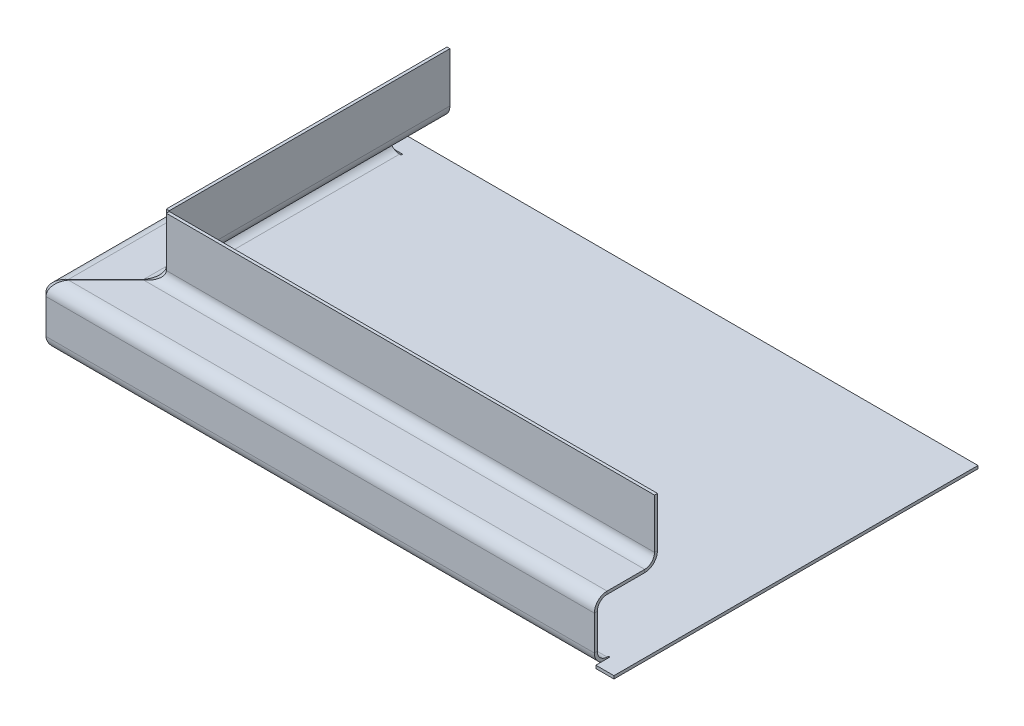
ISO-10303-21;
HEADER;
FILE_DESCRIPTION(('STEP AP214'),'2;1');
FILE_NAME('part.step','',(''),(''),'','','');
FILE_SCHEMA(('AUTOMOTIVE_DESIGN { 1 0 10303 214 1 1 1 1 }'));
ENDSEC;
DATA;
#1=APPLICATION_CONTEXT('core data for automotive mechanical design processes');
#2=APPLICATION_PROTOCOL_DEFINITION('international standard','automotive_design',2000,#1);
#3=PRODUCT_CONTEXT('',#1,'mechanical');
#4=PRODUCT('Part','Part','',(#3));
#5=PRODUCT_RELATED_PRODUCT_CATEGORY('part','',(#4));
#6=PRODUCT_DEFINITION_FORMATION('','',#4);
#7=PRODUCT_DEFINITION_CONTEXT('part definition',#1,'design');
#8=PRODUCT_DEFINITION('design','',#6,#7);
#9=PRODUCT_DEFINITION_SHAPE('','',#8);
#10=(LENGTH_UNIT() NAMED_UNIT(*) SI_UNIT(.MILLI.,.METRE.));
#11=(NAMED_UNIT(*) PLANE_ANGLE_UNIT() SI_UNIT($,.RADIAN.));
#12=(NAMED_UNIT(*) SI_UNIT($,.STERADIAN.) SOLID_ANGLE_UNIT());
#13=UNCERTAINTY_MEASURE_WITH_UNIT(LENGTH_MEASURE(1.E-05),#10,'distance_accuracy_value','');
#14=(GEOMETRIC_REPRESENTATION_CONTEXT(3) GLOBAL_UNCERTAINTY_ASSIGNED_CONTEXT((#13)) GLOBAL_UNIT_ASSIGNED_CONTEXT((#10,
#11,#12)) REPRESENTATION_CONTEXT('',''));
#15=CARTESIAN_POINT('',(0.,0.,0.));
#16=DIRECTION('',(0.,0.,1.));
#17=DIRECTION('',(1.,0.,0.));
#18=AXIS2_PLACEMENT_3D('',#15,#16,#17);
#19=CARTESIAN_POINT('',(-74.1158902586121,0.762,47.2083385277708));
#20=DIRECTION('',(0.,0.,-1.));
#21=DIRECTION('',(-1.,0.,0.));
#22=AXIS2_PLACEMENT_3D('',#19,#20,#21);
#23=PLANE('',#22);
#24=DIRECTION('',(0.,1.,0.));
#25=VECTOR('',#24,1.);
#26=CARTESIAN_POINT('',(69.4168902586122,0.,47.2083385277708));
#27=LINE('',#26,#25);
#28=CARTESIAN_POINT('',(69.4168902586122,0.,47.2083385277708));
#29=VERTEX_POINT('',#28);
#30=CARTESIAN_POINT('',(69.4168902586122,0.762,47.2083385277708));
#31=VERTEX_POINT('',#30);
#32=EDGE_CURVE('E607',#29,#31,#27,.T.);
#33=ORIENTED_EDGE('',*,*,#32,.F.);
#34=DIRECTION('',(1.,0.,0.));
#35=VECTOR('',#34,1.);
#36=CARTESIAN_POINT('',(-74.1158902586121,0.,47.2083385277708));
#37=LINE('',#36,#35);
#38=CARTESIAN_POINT('',(74.1158902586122,0.,47.2083385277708));
#39=VERTEX_POINT('',#38);
#40=EDGE_CURVE('E616',#29,#39,#37,.T.);
#41=ORIENTED_EDGE('',*,*,#40,.T.);
#42=DIRECTION('',(0.,-1.,0.));
#43=VECTOR('',#42,1.);
#44=CARTESIAN_POINT('',(74.1158902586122,0.762,47.2083385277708));
#45=LINE('',#44,#43);
#46=CARTESIAN_POINT('',(74.1158902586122,0.762,47.2083385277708));
#47=VERTEX_POINT('',#46);
#48=EDGE_CURVE('E11',#47,#39,#45,.T.);
#49=ORIENTED_EDGE('',*,*,#48,.F.);
#50=DIRECTION('',(1.,0.,0.));
#51=VECTOR('',#50,1.);
#52=CARTESIAN_POINT('',(-74.1158902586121,0.762,47.2083385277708));
#53=LINE('',#52,#51);
#54=EDGE_CURVE('E631',#31,#47,#53,.T.);
#55=ORIENTED_EDGE('',*,*,#54,.F.);
#56=EDGE_LOOP('',(#33,#41,#49,#55));
#57=FACE_BOUND('',#56,.T.);
#58=ADVANCED_FACE('F28',(#57),#23,.F.);
#59=CARTESIAN_POINT('',(-74.1158902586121,0.762,47.2083385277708));
#60=DIRECTION('',(0.,1.,0.));
#61=DIRECTION('',(0.,0.,1.));
#62=AXIS2_PLACEMENT_3D('',#59,#60,#61);
#63=PLANE('',#62);
#64=DIRECTION('',(1.,0.,0.));
#65=VECTOR('',#64,1.);
#66=CARTESIAN_POINT('',(69.0358902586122,0.762,43.5253385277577));
#67=LINE('',#66,#65);
#68=CARTESIAN_POINT('',(69.0358902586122,0.762,43.5253385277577));
#69=VERTEX_POINT('',#68);
#70=CARTESIAN_POINT('',(69.4168902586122,0.762,43.5253385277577));
#71=VERTEX_POINT('',#70);
#72=EDGE_CURVE('E586',#69,#71,#67,.T.);
#73=ORIENTED_EDGE('',*,*,#72,.T.);
#74=DIRECTION('',(0.,0.,1.));
#75=VECTOR('',#74,1.);
#76=CARTESIAN_POINT('',(69.4168902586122,0.762,43.5253385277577));
#77=LINE('',#76,#75);
#78=EDGE_CURVE('E590',#71,#31,#77,.T.);
#79=ORIENTED_EDGE('',*,*,#78,.T.);
#80=ORIENTED_EDGE('',*,*,#54,.T.);
#81=DIRECTION('',(0.,0.,-1.));
#82=VECTOR('',#81,1.);
#83=CARTESIAN_POINT('',(74.1158902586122,0.762,-47.2083385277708));
#84=LINE('',#83,#82);
#85=CARTESIAN_POINT('',(74.1158902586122,0.762,-47.2083385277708));
#86=VERTEX_POINT('',#85);
#87=EDGE_CURVE('E633',#47,#86,#84,.T.);
#88=ORIENTED_EDGE('',*,*,#87,.T.);
#89=DIRECTION('',(-1.,0.,0.));
#90=VECTOR('',#89,1.);
#91=CARTESIAN_POINT('',(-74.1158902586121,0.762,-47.2083385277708));
#92=LINE('',#91,#90);
#93=CARTESIAN_POINT('',(-74.1158902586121,0.762,-47.2083385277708));
#94=VERTEX_POINT('',#93);
#95=EDGE_CURVE('E53',#86,#94,#92,.T.);
#96=ORIENTED_EDGE('',*,*,#95,.T.);
#97=DIRECTION('',(0.,0.,1.));
#98=VECTOR('',#97,1.);
#99=CARTESIAN_POINT('',(-74.1158902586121,0.762,-47.2083385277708));
#100=LINE('',#99,#98);
#101=CARTESIAN_POINT('',(-74.1158902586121,0.762,-42.5093385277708));
#102=VERTEX_POINT('',#101);
#103=EDGE_CURVE('E629',#94,#102,#100,.T.);
#104=ORIENTED_EDGE('',*,*,#103,.T.);
#105=DIRECTION('',(-1.,0.,0.));
#106=VECTOR('',#105,1.);
#107=CARTESIAN_POINT('',(-70.432890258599,0.762,-42.5093385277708));
#108=LINE('',#107,#106);
#109=CARTESIAN_POINT('',(-70.432890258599,0.762,-42.5093385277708));
#110=VERTEX_POINT('',#109);
#111=EDGE_CURVE('E569',#110,#102,#108,.T.);
#112=ORIENTED_EDGE('',*,*,#111,.F.);
#113=DIRECTION('',(0.,0.,-1.));
#114=VECTOR('',#113,1.);
#115=CARTESIAN_POINT('',(-70.432890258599,0.762,-42.1283385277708));
#116=LINE('',#115,#114);
#117=CARTESIAN_POINT('',(-70.432890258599,0.762,-42.1283385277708));
#118=VERTEX_POINT('',#117);
#119=EDGE_CURVE('E557',#118,#110,#116,.T.);
#120=ORIENTED_EDGE('',*,*,#119,.F.);
#121=DIRECTION('',(1.,0.,0.));
#122=VECTOR('',#121,1.);
#123=CARTESIAN_POINT('',(-74.1158902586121,0.762,-42.1283385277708));
#124=LINE('',#123,#122);
#125=CARTESIAN_POINT('',(-70.813890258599,0.762,-42.1283385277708));
#126=VERTEX_POINT('',#125);
#127=EDGE_CURVE('E552',#126,#118,#124,.T.);
#128=ORIENTED_EDGE('',*,*,#127,.F.);
#129=DIRECTION('',(0.,0.,-1.));
#130=VECTOR('',#129,1.);
#131=CARTESIAN_POINT('',(-70.813890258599,0.762000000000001,47.2083385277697));
#132=LINE('',#131,#130);
#133=CARTESIAN_POINT('',(-70.8138902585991,0.762000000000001,43.906338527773));
#134=VERTEX_POINT('',#133);
#135=EDGE_CURVE('E295',#134,#126,#132,.T.);
#136=ORIENTED_EDGE('',*,*,#135,.F.);
#137=DIRECTION('',(-1.,0.,0.));
#138=VECTOR('',#137,1.);
#139=CARTESIAN_POINT('',(815.274792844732,0.762000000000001,43.9063385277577));
#140=LINE('',#139,#138);
#141=CARTESIAN_POINT('',(69.0358902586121,0.762000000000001,43.9063385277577));
#142=VERTEX_POINT('',#141);
#143=EDGE_CURVE('E422',#142,#134,#140,.T.);
#144=ORIENTED_EDGE('',*,*,#143,.F.);
#145=DIRECTION('',(0.,0.,-1.));
#146=VECTOR('',#145,1.);
#147=CARTESIAN_POINT('',(69.0358902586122,0.762,47.2083385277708));
#148=LINE('',#147,#146);
#149=EDGE_CURVE('E581',#142,#69,#148,.T.);
#150=ORIENTED_EDGE('',*,*,#149,.T.);
#151=EDGE_LOOP('',(#73,#79,#80,#88,#96,#104,#112,#120,#128,#136,#144,#150));
#152=FACE_BOUND('',#151,.T.);
#153=ADVANCED_FACE('F673',(#152),#63,.T.);
#154=CARTESIAN_POINT('',(-74.1158902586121,0.,47.2083385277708));
#155=DIRECTION('',(0.,1.,0.));
#156=DIRECTION('',(0.,0.,1.));
#157=AXIS2_PLACEMENT_3D('',#154,#155,#156);
#158=PLANE('',#157);
#159=DIRECTION('',(0.,0.,1.));
#160=VECTOR('',#159,1.);
#161=CARTESIAN_POINT('',(69.4168902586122,0.,43.5253385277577));
#162=LINE('',#161,#160);
#163=CARTESIAN_POINT('',(69.4168902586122,0.,43.5253385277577));
#164=VERTEX_POINT('',#163);
#165=EDGE_CURVE('E605',#164,#29,#162,.T.);
#166=ORIENTED_EDGE('',*,*,#165,.F.);
#167=DIRECTION('',(1.,0.,0.));
#168=VECTOR('',#167,1.);
#169=CARTESIAN_POINT('',(69.0358902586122,0.,43.5253385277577));
#170=LINE('',#169,#168);
#171=CARTESIAN_POINT('',(69.0358902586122,0.,43.5253385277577));
#172=VERTEX_POINT('',#171);
#173=EDGE_CURVE('E598',#172,#164,#170,.T.);
#174=ORIENTED_EDGE('',*,*,#173,.F.);
#175=DIRECTION('',(0.,0.,-1.));
#176=VECTOR('',#175,1.);
#177=CARTESIAN_POINT('',(69.0358902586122,0.,47.2083385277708));
#178=LINE('',#177,#176);
#179=CARTESIAN_POINT('',(69.0358902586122,0.,43.9063385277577));
#180=VERTEX_POINT('',#179);
#181=EDGE_CURVE('E595',#180,#172,#178,.T.);
#182=ORIENTED_EDGE('',*,*,#181,.F.);
#183=DIRECTION('',(-1.,0.,0.));
#184=VECTOR('',#183,1.);
#185=CARTESIAN_POINT('',(815.274792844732,0.,43.9063385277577));
#186=LINE('',#185,#184);
#187=CARTESIAN_POINT('',(-70.813890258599,0.,43.9063385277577));
#188=VERTEX_POINT('',#187);
#189=EDGE_CURVE('E403',#180,#188,#186,.T.);
#190=ORIENTED_EDGE('',*,*,#189,.T.);
#191=DIRECTION('',(0.,0.,-1.));
#192=VECTOR('',#191,1.);
#193=CARTESIAN_POINT('',(-70.813890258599,0.,47.2083385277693));
#194=LINE('',#193,#192);
#195=CARTESIAN_POINT('',(-70.813890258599,0.,-42.1283385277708));
#196=VERTEX_POINT('',#195);
#197=EDGE_CURVE('E307',#188,#196,#194,.T.);
#198=ORIENTED_EDGE('',*,*,#197,.T.);
#199=DIRECTION('',(1.,0.,0.));
#200=VECTOR('',#199,1.);
#201=CARTESIAN_POINT('',(-74.1158902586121,0.,-42.1283385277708));
#202=LINE('',#201,#200);
#203=CARTESIAN_POINT('',(-70.432890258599,0.,-42.1283385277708));
#204=VERTEX_POINT('',#203);
#205=EDGE_CURVE('E564',#196,#204,#202,.T.);
#206=ORIENTED_EDGE('',*,*,#205,.T.);
#207=DIRECTION('',(0.,0.,-1.));
#208=VECTOR('',#207,1.);
#209=CARTESIAN_POINT('',(-70.432890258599,0.,-42.1283385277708));
#210=LINE('',#209,#208);
#211=CARTESIAN_POINT('',(-70.432890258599,0.,-42.5093385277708));
#212=VERTEX_POINT('',#211);
#213=EDGE_CURVE('E568',#204,#212,#210,.T.);
#214=ORIENTED_EDGE('',*,*,#213,.T.);
#215=DIRECTION('',(-1.,0.,0.));
#216=VECTOR('',#215,1.);
#217=CARTESIAN_POINT('',(-70.432890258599,0.,-42.5093385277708));
#218=LINE('',#217,#216);
#219=CARTESIAN_POINT('',(-74.1158902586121,0.,-42.5093385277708));
#220=VERTEX_POINT('',#219);
#221=EDGE_CURVE('E576',#212,#220,#218,.T.);
#222=ORIENTED_EDGE('',*,*,#221,.T.);
#223=DIRECTION('',(0.,0.,1.));
#224=VECTOR('',#223,1.);
#225=CARTESIAN_POINT('',(-74.1158902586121,0.,-47.2083385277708));
#226=LINE('',#225,#224);
#227=CARTESIAN_POINT('',(-74.1158902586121,0.,-47.2083385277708));
#228=VERTEX_POINT('',#227);
#229=EDGE_CURVE('E599',#228,#220,#226,.T.);
#230=ORIENTED_EDGE('',*,*,#229,.F.);
#231=DIRECTION('',(-1.,0.,0.));
#232=VECTOR('',#231,1.);
#233=CARTESIAN_POINT('',(-74.1158902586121,0.,-47.2083385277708));
#234=LINE('',#233,#232);
#235=CARTESIAN_POINT('',(74.1158902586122,0.,-47.2083385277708));
#236=VERTEX_POINT('',#235);
#237=EDGE_CURVE('E625',#236,#228,#234,.T.);
#238=ORIENTED_EDGE('',*,*,#237,.F.);
#239=DIRECTION('',(0.,0.,-1.));
#240=VECTOR('',#239,1.);
#241=CARTESIAN_POINT('',(74.1158902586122,0.,-47.2083385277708));
#242=LINE('',#241,#240);
#243=EDGE_CURVE('E620',#39,#236,#242,.T.);
#244=ORIENTED_EDGE('',*,*,#243,.F.);
#245=ORIENTED_EDGE('',*,*,#40,.F.);
#246=EDGE_LOOP('',(#166,#174,#182,#190,#198,#206,#214,#222,#230,#238,#244,#245));
#247=FACE_BOUND('',#246,.T.);
#248=ADVANCED_FACE('F681',(#247),#158,.F.);
#249=CARTESIAN_POINT('',(-74.1158902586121,0.762,-47.2083385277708));
#250=DIRECTION('',(1.,0.,0.));
#251=DIRECTION('',(0.,0.,-1.));
#252=AXIS2_PLACEMENT_3D('',#249,#250,#251);
#253=PLANE('',#252);
#254=ORIENTED_EDGE('',*,*,#229,.T.);
#255=DIRECTION('',(0.,1.,0.));
#256=VECTOR('',#255,1.);
#257=CARTESIAN_POINT('',(-74.1158902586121,0.,-42.5093385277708));
#258=LINE('',#257,#256);
#259=EDGE_CURVE('E45',#220,#102,#258,.T.);
#260=ORIENTED_EDGE('',*,*,#259,.T.);
#261=ORIENTED_EDGE('',*,*,#103,.F.);
#262=DIRECTION('',(0.,-1.,0.));
#263=VECTOR('',#262,1.);
#264=CARTESIAN_POINT('',(-74.1158902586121,0.762,-47.2083385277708));
#265=LINE('',#264,#263);
#266=EDGE_CURVE('E636',#94,#228,#265,.T.);
#267=ORIENTED_EDGE('',*,*,#266,.T.);
#268=EDGE_LOOP('',(#254,#260,#261,#267));
#269=FACE_BOUND('',#268,.T.);
#270=ADVANCED_FACE('F30',(#269),#253,.F.);
#271=CARTESIAN_POINT('',(74.1158902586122,0.762,-47.2083385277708));
#272=DIRECTION('',(-1.,0.,0.));
#273=DIRECTION('',(0.,0.,1.));
#274=AXIS2_PLACEMENT_3D('',#271,#272,#273);
#275=PLANE('',#274);
#276=ORIENTED_EDGE('',*,*,#243,.T.);
#277=DIRECTION('',(0.,-1.,0.));
#278=VECTOR('',#277,1.);
#279=CARTESIAN_POINT('',(74.1158902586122,0.762,-47.2083385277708));
#280=LINE('',#279,#278);
#281=EDGE_CURVE('E37',#86,#236,#280,.T.);
#282=ORIENTED_EDGE('',*,*,#281,.F.);
#283=ORIENTED_EDGE('',*,*,#87,.F.);
#284=ORIENTED_EDGE('',*,*,#48,.T.);
#285=EDGE_LOOP('',(#276,#282,#283,#284));
#286=FACE_BOUND('',#285,.T.);
#287=ADVANCED_FACE('F701',(#286),#275,.F.);
#288=CARTESIAN_POINT('',(-74.1158902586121,0.762,-47.2083385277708));
#289=DIRECTION('',(0.,0.,1.));
#290=DIRECTION('',(1.,0.,0.));
#291=AXIS2_PLACEMENT_3D('',#288,#289,#290);
#292=PLANE('',#291);
#293=ORIENTED_EDGE('',*,*,#237,.T.);
#294=ORIENTED_EDGE('',*,*,#266,.F.);
#295=ORIENTED_EDGE('',*,*,#95,.F.);
#296=ORIENTED_EDGE('',*,*,#281,.T.);
#297=EDGE_LOOP('',(#293,#294,#295,#296));
#298=FACE_BOUND('',#297,.T.);
#299=ADVANCED_FACE('F704',(#298),#292,.F.);
#300=CARTESIAN_POINT('',(69.0358902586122,0.,47.2083385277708));
#301=DIRECTION('',(1.,0.,0.));
#302=DIRECTION('',(0.,0.,-1.));
#303=AXIS2_PLACEMENT_3D('',#300,#301,#302);
#304=PLANE('',#303);
#305=ORIENTED_EDGE('',*,*,#181,.T.);
#306=DIRECTION('',(0.,1.,0.));
#307=VECTOR('',#306,1.);
#308=CARTESIAN_POINT('',(69.0358902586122,0.,43.5253385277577));
#309=LINE('',#308,#307);
#310=EDGE_CURVE('E593',#172,#69,#309,.T.);
#311=ORIENTED_EDGE('',*,*,#310,.T.);
#312=ORIENTED_EDGE('',*,*,#149,.F.);
#313=DIRECTION('',(0.,-1.,0.));
#314=VECTOR('',#313,1.);
#315=CARTESIAN_POINT('',(69.0358902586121,0.,43.9063385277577));
#316=LINE('',#315,#314);
#317=EDGE_CURVE('E431',#180,#142,#316,.F.);
#318=ORIENTED_EDGE('',*,*,#317,.F.);
#319=EDGE_LOOP('',(#305,#311,#312,#318));
#320=FACE_BOUND('',#319,.T.);
#321=ADVANCED_FACE('F706',(#320),#304,.T.);
#322=CARTESIAN_POINT('',(69.0358902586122,0.,43.5253385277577));
#323=DIRECTION('',(0.,0.,1.));
#324=DIRECTION('',(1.,0.,0.));
#325=AXIS2_PLACEMENT_3D('',#322,#323,#324);
#326=PLANE('',#325);
#327=ORIENTED_EDGE('',*,*,#72,.F.);
#328=ORIENTED_EDGE('',*,*,#310,.F.);
#329=ORIENTED_EDGE('',*,*,#173,.T.);
#330=DIRECTION('',(0.,1.,0.));
#331=VECTOR('',#330,1.);
#332=CARTESIAN_POINT('',(69.4168902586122,0.,43.5253385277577));
#333=LINE('',#332,#331);
#334=EDGE_CURVE('E608',#164,#71,#333,.T.);
#335=ORIENTED_EDGE('',*,*,#334,.T.);
#336=EDGE_LOOP('',(#327,#328,#329,#335));
#337=FACE_BOUND('',#336,.T.);
#338=ADVANCED_FACE('F712',(#337),#326,.T.);
#339=CARTESIAN_POINT('',(69.4168902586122,0.,43.5253385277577));
#340=DIRECTION('',(-1.,0.,0.));
#341=DIRECTION('',(0.,0.,1.));
#342=AXIS2_PLACEMENT_3D('',#339,#340,#341);
#343=PLANE('',#342);
#344=ORIENTED_EDGE('',*,*,#78,.F.);
#345=ORIENTED_EDGE('',*,*,#334,.F.);
#346=ORIENTED_EDGE('',*,*,#165,.T.);
#347=ORIENTED_EDGE('',*,*,#32,.T.);
#348=EDGE_LOOP('',(#344,#345,#346,#347));
#349=FACE_BOUND('',#348,.T.);
#350=ADVANCED_FACE('F692',(#349),#343,.T.);
#351=CARTESIAN_POINT('',(-74.1158902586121,0.,-42.1283385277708));
#352=DIRECTION('',(0.,0.,1.));
#353=DIRECTION('',(1.,0.,0.));
#354=AXIS2_PLACEMENT_3D('',#351,#352,#353);
#355=PLANE('',#354);
#356=DIRECTION('',(0.,-1.,0.));
#357=VECTOR('',#356,1.);
#358=CARTESIAN_POINT('',(-70.8138902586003,0.,-42.1283385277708));
#359=LINE('',#358,#357);
#360=EDGE_CURVE('E299',#196,#126,#359,.F.);
#361=ORIENTED_EDGE('',*,*,#360,.T.);
#362=ORIENTED_EDGE('',*,*,#127,.T.);
#363=DIRECTION('',(0.,1.,0.));
#364=VECTOR('',#363,1.);
#365=CARTESIAN_POINT('',(-70.432890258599,0.,-42.1283385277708));
#366=LINE('',#365,#364);
#367=EDGE_CURVE('E562',#204,#118,#366,.T.);
#368=ORIENTED_EDGE('',*,*,#367,.F.);
#369=ORIENTED_EDGE('',*,*,#205,.F.);
#370=EDGE_LOOP('',(#361,#362,#368,#369));
#371=FACE_BOUND('',#370,.T.);
#372=ADVANCED_FACE('F672',(#371),#355,.F.);
#373=CARTESIAN_POINT('',(-70.432890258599,0.,-42.1283385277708));
#374=DIRECTION('',(1.,0.,0.));
#375=DIRECTION('',(0.,0.,-1.));
#376=AXIS2_PLACEMENT_3D('',#373,#374,#375);
#377=PLANE('',#376);
#378=ORIENTED_EDGE('',*,*,#119,.T.);
#379=DIRECTION('',(0.,1.,0.));
#380=VECTOR('',#379,1.);
#381=CARTESIAN_POINT('',(-70.432890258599,0.,-42.5093385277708));
#382=LINE('',#381,#380);
#383=EDGE_CURVE('E578',#212,#110,#382,.T.);
#384=ORIENTED_EDGE('',*,*,#383,.F.);
#385=ORIENTED_EDGE('',*,*,#213,.F.);
#386=ORIENTED_EDGE('',*,*,#367,.T.);
#387=EDGE_LOOP('',(#378,#384,#385,#386));
#388=FACE_BOUND('',#387,.T.);
#389=ADVANCED_FACE('F683',(#388),#377,.F.);
#390=CARTESIAN_POINT('',(-70.432890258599,0.,-42.5093385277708));
#391=DIRECTION('',(0.,0.,-1.));
#392=DIRECTION('',(-1.,0.,0.));
#393=AXIS2_PLACEMENT_3D('',#390,#391,#392);
#394=PLANE('',#393);
#395=ORIENTED_EDGE('',*,*,#111,.T.);
#396=ORIENTED_EDGE('',*,*,#259,.F.);
#397=ORIENTED_EDGE('',*,*,#221,.F.);
#398=ORIENTED_EDGE('',*,*,#383,.T.);
#399=EDGE_LOOP('',(#395,#396,#397,#398));
#400=FACE_BOUND('',#399,.T.);
#401=ADVANCED_FACE('F675',(#400),#394,.F.);
#402=CARTESIAN_POINT('',(69.0358902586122,12.2664397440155,47.2083385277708));
#403=DIRECTION('',(-1.,0.,0.));
#404=DIRECTION('',(0.,1.,1.46228580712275E-12));
#405=AXIS2_PLACEMENT_3D('',#402,#403,#404);
#406=PLANE('',#405);
#407=DIRECTION('',(0.,-1.46228580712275E-12,1.));
#408=VECTOR('',#407,1.);
#409=CARTESIAN_POINT('',(69.0358902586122,3.30199999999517,47.2083385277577));
#410=LINE('',#409,#408);
#411=CARTESIAN_POINT('',(69.0358902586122,3.30199999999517,47.2083385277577));
#412=VERTEX_POINT('',#411);
#413=CARTESIAN_POINT('',(69.0358902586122,3.30199999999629,46.4463385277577));
#414=VERTEX_POINT('',#413);
#415=EDGE_CURVE('E549',#412,#414,#410,.F.);
#416=ORIENTED_EDGE('',*,*,#415,.T.);
#417=DIRECTION('',(0.,1.,1.46228580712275E-12));
#418=VECTOR('',#417,1.);
#419=CARTESIAN_POINT('',(69.0358902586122,12.2664397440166,46.4463385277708));
#420=LINE('',#419,#418);
#421=CARTESIAN_POINT('',(69.0358902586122,12.2664397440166,46.4463385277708));
#422=VERTEX_POINT('',#421);
#423=EDGE_CURVE('E498',#422,#414,#420,.F.);
#424=ORIENTED_EDGE('',*,*,#423,.F.);
#425=DIRECTION('',(0.,0.,1.));
#426=VECTOR('',#425,1.);
#427=CARTESIAN_POINT('',(69.0358902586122,12.2664397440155,47.2083385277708));
#428=LINE('',#427,#426);
#429=CARTESIAN_POINT('',(69.0358902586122,12.2664397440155,47.2083385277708));
#430=VERTEX_POINT('',#429);
#431=EDGE_CURVE('E546',#430,#422,#428,.F.);
#432=ORIENTED_EDGE('',*,*,#431,.F.);
#433=DIRECTION('',(0.,1.,1.46228580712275E-12));
#434=VECTOR('',#433,1.);
#435=CARTESIAN_POINT('',(69.0358902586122,12.2664397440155,47.2083385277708));
#436=LINE('',#435,#434);
#437=EDGE_CURVE('E454',#430,#412,#436,.F.);
#438=ORIENTED_EDGE('',*,*,#437,.T.);
#439=EDGE_LOOP('',(#416,#424,#432,#438));
#440=FACE_BOUND('',#439,.T.);
#441=ADVANCED_FACE('F690',(#440),#406,.F.);
#442=CARTESIAN_POINT('',(69.0358902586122,12.2664397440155,43.9063385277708));
#443=DIRECTION('',(1.,0.,0.));
#444=DIRECTION('',(0.,0.,-1.));
#445=AXIS2_PLACEMENT_3D('',#442,#443,#444);
#446=PLANE('',#445);
#447=ORIENTED_EDGE('',*,*,#431,.T.);
#448=CARTESIAN_POINT('',(69.0358902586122,12.2664397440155,43.9063385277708));
#449=DIRECTION('',(-1.,0.,0.));
#450=DIRECTION('',(0.,0.,1.));
#451=AXIS2_PLACEMENT_3D('',#448,#449,#450);
#452=CIRCLE('',#451,2.54);
#453=CARTESIAN_POINT('',(69.0358902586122,14.8064397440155,43.9063385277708));
#454=VERTEX_POINT('',#453);
#455=EDGE_CURVE('E514',#422,#454,#452,.T.);
#456=ORIENTED_EDGE('',*,*,#455,.T.);
#457=DIRECTION('',(0.,1.,0.));
#458=VECTOR('',#457,1.);
#459=CARTESIAN_POINT('',(69.0358902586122,15.5684397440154,43.9063385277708));
#460=LINE('',#459,#458);
#461=CARTESIAN_POINT('',(69.0358902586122,15.5684397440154,43.9063385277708));
#462=VERTEX_POINT('',#461);
#463=EDGE_CURVE('E543',#462,#454,#460,.F.);
#464=ORIENTED_EDGE('',*,*,#463,.F.);
#465=CARTESIAN_POINT('',(69.0358902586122,12.2664397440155,43.9063385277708));
#466=DIRECTION('',(-1.,0.,0.));
#467=DIRECTION('',(0.,0.,1.));
#468=AXIS2_PLACEMENT_3D('',#465,#466,#467);
#469=CIRCLE('',#468,3.302);
#470=EDGE_CURVE('E470',#430,#462,#469,.T.);
#471=ORIENTED_EDGE('',*,*,#470,.F.);
#472=EDGE_LOOP('',(#447,#456,#464,#471));
#473=FACE_BOUND('',#472,.T.);
#474=ADVANCED_FACE('F761',(#473),#446,.T.);
#475=CARTESIAN_POINT('',(69.0358902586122,15.5684397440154,47.2083385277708));
#476=DIRECTION('',(-1.,0.,0.));
#477=DIRECTION('',(0.,0.,1.));
#478=AXIS2_PLACEMENT_3D('',#475,#476,#477);
#479=PLANE('',#478);
#480=ORIENTED_EDGE('',*,*,#463,.T.);
#481=DIRECTION('',(0.,0.,1.));
#482=VECTOR('',#481,1.);
#483=CARTESIAN_POINT('',(69.0358902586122,14.8064397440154,47.2083385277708));
#484=LINE('',#483,#482);
#485=CARTESIAN_POINT('',(69.0358902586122,14.8064397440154,34.1480833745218));
#486=VERTEX_POINT('',#485);
#487=EDGE_CURVE('E511',#454,#486,#484,.F.);
#488=ORIENTED_EDGE('',*,*,#487,.T.);
#489=DIRECTION('',(0.,1.,0.));
#490=VECTOR('',#489,1.);
#491=CARTESIAN_POINT('',(69.0358902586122,15.5684397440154,34.1480833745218));
#492=LINE('',#491,#490);
#493=CARTESIAN_POINT('',(69.0358902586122,15.5684397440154,34.1480833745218));
#494=VERTEX_POINT('',#493);
#495=EDGE_CURVE('E540',#494,#486,#492,.F.);
#496=ORIENTED_EDGE('',*,*,#495,.F.);
#497=DIRECTION('',(0.,0.,1.));
#498=VECTOR('',#497,1.);
#499=CARTESIAN_POINT('',(69.0358902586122,15.5684397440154,47.2083385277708));
#500=LINE('',#499,#498);
#501=EDGE_CURVE('E467',#462,#494,#500,.F.);
#502=ORIENTED_EDGE('',*,*,#501,.F.);
#503=EDGE_LOOP('',(#480,#488,#496,#502));
#504=FACE_BOUND('',#503,.T.);
#505=ADVANCED_FACE('F978',(#504),#479,.F.);
#506=CARTESIAN_POINT('',(69.0358902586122,18.1084397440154,34.1480833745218));
#507=DIRECTION('',(1.,0.,0.));
#508=DIRECTION('',(0.,0.,-1.));
#509=AXIS2_PLACEMENT_3D('',#506,#507,#508);
#510=PLANE('',#509);
#511=ORIENTED_EDGE('',*,*,#495,.T.);
#512=CARTESIAN_POINT('',(69.0358902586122,18.1084397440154,34.1480833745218));
#513=DIRECTION('',(-1.,0.,0.));
#514=DIRECTION('',(0.,0.,1.));
#515=AXIS2_PLACEMENT_3D('',#512,#513,#514);
#516=CIRCLE('',#515,3.302);
#517=CARTESIAN_POINT('',(69.0358902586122,18.1084397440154,30.8460833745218));
#518=VERTEX_POINT('',#517);
#519=EDGE_CURVE('E508',#486,#518,#516,.F.);
#520=ORIENTED_EDGE('',*,*,#519,.T.);
#521=DIRECTION('',(0.,0.,1.));
#522=VECTOR('',#521,1.);
#523=CARTESIAN_POINT('',(69.0358902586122,18.1084397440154,31.6080833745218));
#524=LINE('',#523,#522);
#525=CARTESIAN_POINT('',(69.0358902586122,18.1084397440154,31.6080833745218));
#526=VERTEX_POINT('',#525);
#527=EDGE_CURVE('E537',#526,#518,#524,.F.);
#528=ORIENTED_EDGE('',*,*,#527,.F.);
#529=CARTESIAN_POINT('',(69.0358902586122,18.1084397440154,34.1480833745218));
#530=DIRECTION('',(-1.,0.,0.));
#531=DIRECTION('',(0.,0.,1.));
#532=AXIS2_PLACEMENT_3D('',#529,#530,#531);
#533=CIRCLE('',#532,2.54);
#534=EDGE_CURVE('E464',#494,#526,#533,.F.);
#535=ORIENTED_EDGE('',*,*,#534,.F.);
#536=EDGE_LOOP('',(#511,#520,#528,#535));
#537=FACE_BOUND('',#536,.T.);
#538=ADVANCED_FACE('F974',(#537),#510,.T.);
#539=CARTESIAN_POINT('',(69.0358902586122,15.5684397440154,31.6080833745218));
#540=DIRECTION('',(1.,0.,0.));
#541=DIRECTION('',(0.,1.,0.));
#542=AXIS2_PLACEMENT_3D('',#539,#540,#541);
#543=PLANE('',#542);
#544=ORIENTED_EDGE('',*,*,#527,.T.);
#545=DIRECTION('',(0.,1.,0.));
#546=VECTOR('',#545,1.);
#547=CARTESIAN_POINT('',(69.0358902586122,15.5684397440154,30.8460833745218));
#548=LINE('',#547,#546);
#549=CARTESIAN_POINT('',(69.0358902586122,30.9804524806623,30.8460833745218));
#550=VERTEX_POINT('',#549);
#551=EDGE_CURVE('E505',#518,#550,#548,.T.);
#552=ORIENTED_EDGE('',*,*,#551,.T.);
#553=DIRECTION('',(0.,0.,1.));
#554=VECTOR('',#553,1.);
#555=CARTESIAN_POINT('',(69.0358902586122,30.9804524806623,31.6080833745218));
#556=LINE('',#555,#554);
#557=CARTESIAN_POINT('',(69.0358902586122,30.9804524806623,31.6080833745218));
#558=VERTEX_POINT('',#557);
#559=EDGE_CURVE('E534',#558,#550,#556,.F.);
#560=ORIENTED_EDGE('',*,*,#559,.F.);
#561=DIRECTION('',(0.,1.,0.));
#562=VECTOR('',#561,1.);
#563=CARTESIAN_POINT('',(69.0358902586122,15.5684397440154,31.6080833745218));
#564=LINE('',#563,#562);
#565=EDGE_CURVE('E461',#526,#558,#564,.T.);
#566=ORIENTED_EDGE('',*,*,#565,.F.);
#567=EDGE_LOOP('',(#544,#552,#560,#566));
#568=FACE_BOUND('',#567,.T.);
#569=ADVANCED_FACE('F970',(#568),#543,.T.);
#570=CARTESIAN_POINT('',(74.1158902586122,30.9804524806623,31.6080833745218));
#571=DIRECTION('',(0.,-1.,0.));
#572=DIRECTION('',(1.,0.,0.));
#573=AXIS2_PLACEMENT_3D('',#570,#571,#572);
#574=PLANE('',#573);
#575=ORIENTED_EDGE('',*,*,#559,.T.);
#576=DIRECTION('',(1.,0.,0.));
#577=VECTOR('',#576,1.);
#578=CARTESIAN_POINT('',(74.1158902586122,30.9804524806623,30.8460833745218));
#579=LINE('',#578,#577);
#580=CARTESIAN_POINT('',(-57.5740299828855,30.9804524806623,30.8460833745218));
#581=VERTEX_POINT('',#580);
#582=EDGE_CURVE('E484',#550,#581,#579,.F.);
#583=ORIENTED_EDGE('',*,*,#582,.T.);
#584=DIRECTION('',(0.,0.,1.));
#585=VECTOR('',#584,1.);
#586=CARTESIAN_POINT('',(-57.5740299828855,30.9804524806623,31.6080833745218));
#587=LINE('',#586,#585);
#588=CARTESIAN_POINT('',(-57.5740299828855,30.9804524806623,31.6080833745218));
#589=VERTEX_POINT('',#588);
#590=EDGE_CURVE('E531',#589,#581,#587,.F.);
#591=ORIENTED_EDGE('',*,*,#590,.F.);
#592=DIRECTION('',(1.,0.,0.));
#593=VECTOR('',#592,1.);
#594=CARTESIAN_POINT('',(74.1158902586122,30.9804524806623,31.6080833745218));
#595=LINE('',#594,#593);
#596=EDGE_CURVE('E439',#558,#589,#595,.F.);
#597=ORIENTED_EDGE('',*,*,#596,.F.);
#598=EDGE_LOOP('',(#575,#583,#591,#597));
#599=FACE_BOUND('',#598,.T.);
#600=ADVANCED_FACE('F966',(#599),#574,.F.);
#601=CARTESIAN_POINT('',(-57.5740299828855,15.5684397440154,31.6080833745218));
#602=DIRECTION('',(1.,0.,0.));
#603=DIRECTION('',(0.,1.,0.));
#604=AXIS2_PLACEMENT_3D('',#601,#602,#603);
#605=PLANE('',#604);
#606=ORIENTED_EDGE('',*,*,#590,.T.);
#607=DIRECTION('',(0.,1.,0.));
#608=VECTOR('',#607,1.);
#609=CARTESIAN_POINT('',(-57.5740299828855,15.5684397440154,30.8460833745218));
#610=LINE('',#609,#608);
#611=CARTESIAN_POINT('',(-57.5740299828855,18.1084397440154,30.8460833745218));
#612=VERTEX_POINT('',#611);
#613=EDGE_CURVE('E497',#581,#612,#610,.F.);
#614=ORIENTED_EDGE('',*,*,#613,.T.);
#615=DIRECTION('',(0.,0.,1.));
#616=VECTOR('',#615,1.);
#617=CARTESIAN_POINT('',(-57.5740299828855,18.1084397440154,31.6080833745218));
#618=LINE('',#617,#616);
#619=CARTESIAN_POINT('',(-57.5740299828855,18.1084397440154,31.6080833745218));
#620=VERTEX_POINT('',#619);
#621=EDGE_CURVE('E528',#620,#612,#618,.F.);
#622=ORIENTED_EDGE('',*,*,#621,.F.);
#623=DIRECTION('',(0.,1.,0.));
#624=VECTOR('',#623,1.);
#625=CARTESIAN_POINT('',(-57.5740299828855,15.5684397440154,31.6080833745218));
#626=LINE('',#625,#624);
#627=EDGE_CURVE('E453',#589,#620,#626,.F.);
#628=ORIENTED_EDGE('',*,*,#627,.F.);
#629=EDGE_LOOP('',(#606,#614,#622,#628));
#630=FACE_BOUND('',#629,.T.);
#631=ADVANCED_FACE('F957',(#630),#605,.F.);
#632=CARTESIAN_POINT('',(-64.1780299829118,18.1084397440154,36.6880833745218));
#633=CARTESIAN_POINT('',(-64.1780299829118,18.1084397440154,36.9420833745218));
#634=CARTESIAN_POINT('',(-64.1780299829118,18.1084397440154,37.1960833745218));
#635=CARTESIAN_POINT('',(-64.1780299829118,18.1084397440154,37.4500833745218));
#636=CARTESIAN_POINT('',(-64.1780299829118,23.1884397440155,36.6880833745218));
#637=CARTESIAN_POINT('',(-64.1780299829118,23.6964397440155,36.9420833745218));
#638=CARTESIAN_POINT('',(-64.1780299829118,24.2044397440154,37.1960833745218));
#639=CARTESIAN_POINT('',(-64.1780299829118,24.7124397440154,37.4500833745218));
#640=CARTESIAN_POINT('',(-57.5740299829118,23.1884397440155,31.6080833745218));
#641=CARTESIAN_POINT('',(-57.5740299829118,23.6964397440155,31.3540833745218));
#642=CARTESIAN_POINT('',(-57.5740299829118,24.2044397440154,31.1000833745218));
#643=CARTESIAN_POINT('',(-57.5740299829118,24.7124397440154,30.8460833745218));
#644=CARTESIAN_POINT('',(-57.5740299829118,18.1084397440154,31.6080833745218));
#645=CARTESIAN_POINT('',(-57.5740299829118,18.1084397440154,31.3540833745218));
#646=CARTESIAN_POINT('',(-57.5740299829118,18.1084397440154,31.1000833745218));
#647=CARTESIAN_POINT('',(-57.5740299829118,18.1084397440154,30.8460833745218));
#648=CARTESIAN_POINT('',(-57.5740299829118,13.0284397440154,31.6080833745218));
#649=CARTESIAN_POINT('',(-57.5740299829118,12.5204397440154,31.3540833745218));
#650=CARTESIAN_POINT('',(-57.5740299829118,12.0124397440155,31.1000833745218));
#651=CARTESIAN_POINT('',(-57.5740299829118,11.5044397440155,30.8460833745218));
#652=CARTESIAN_POINT('',(-64.1780299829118,13.0284397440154,36.6880833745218));
#653=CARTESIAN_POINT('',(-64.1780299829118,12.5204397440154,36.9420833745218));
#654=CARTESIAN_POINT('',(-64.1780299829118,12.0124397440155,37.1960833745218));
#655=CARTESIAN_POINT('',(-64.1780299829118,11.5044397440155,37.4500833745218));
#656=CARTESIAN_POINT('',(-64.1780299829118,18.1084397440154,36.6880833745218));
#657=CARTESIAN_POINT('',(-64.1780299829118,18.1084397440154,36.9420833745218));
#658=CARTESIAN_POINT('',(-64.1780299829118,18.1084397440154,37.1960833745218));
#659=CARTESIAN_POINT('',(-64.1780299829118,18.1084397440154,37.4500833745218));
#660=(BOUNDED_SURFACE() B_SPLINE_SURFACE(3,3,((#632,#633,#634,#635),(#636,#637,#638,#639),(#640,
#641,#642,#643),(#644,#645,#646,#647),(#648,#649,#650,#651),(#652,#653,#654,#655),(#656,#657,
#658,#659)),.UNSPECIFIED.,.T.,.F.,.F.) B_SPLINE_SURFACE_WITH_KNOTS((4,3,4),(4,4),(0.,0.5,1.),
(0.,1.),.UNSPECIFIED.) GEOMETRIC_REPRESENTATION_ITEM() RATIONAL_B_SPLINE_SURFACE(((1.,1.,1.,1.),
(0.333333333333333,0.333333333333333,0.333333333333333,0.333333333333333),(0.333333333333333,
0.333333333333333,0.333333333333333,0.333333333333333),(1.,1.,1.,1.),(0.333333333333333,
0.333333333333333,0.333333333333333,0.333333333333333),(0.333333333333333,0.333333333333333,
0.333333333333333,0.333333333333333),(1.,1.,1.,1.))) REPRESENTATION_ITEM('') SURFACE());
#661=CARTESIAN_POINT('',(-60.8760299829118,18.1084397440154,34.1480833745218));
#662=DIRECTION('',(-0.707106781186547,0.,-0.707106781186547));
#663=DIRECTION('',(-0.707106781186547,0.,0.707106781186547));
#664=AXIS2_PLACEMENT_3D('',#661,#662,#663);
#665=ELLIPSE('',#664,4.66973318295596,3.302);
#666=CARTESIAN_POINT('',(-60.8760299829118,14.8064397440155,34.1480833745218));
#667=VERTEX_POINT('',#666);
#668=EDGE_CURVE('E493',#612,#667,#665,.T.);
#669=DIRECTION('',(0.,1.,0.));
#670=VECTOR('',#669,1.);
#671=CARTESIAN_POINT('',(-60.8760299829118,15.5684397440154,34.1480833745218));
#672=LINE('',#671,#670);
#673=CARTESIAN_POINT('',(-60.8760299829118,15.5684397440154,34.1480833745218));
#674=VERTEX_POINT('',#673);
#675=EDGE_CURVE('E525',#674,#667,#672,.F.);
#676=CARTESIAN_POINT('',(-60.8760299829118,18.1084397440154,34.1480833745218));
#677=DIRECTION('',(-0.609710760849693,0.,-0.7926239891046));
#678=DIRECTION('',(-0.7926239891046,0.,0.609710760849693));
#679=AXIS2_PLACEMENT_3D('',#676,#677,#678);
#680=ELLIPSE('',#679,4.16590974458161,2.54);
#681=EDGE_CURVE('E449',#620,#674,#680,.T.);
#682=ORIENTED_EDGE('',*,*,#621,.T.);
#683=ORIENTED_EDGE('',*,*,#668,.T.);
#684=ORIENTED_EDGE('',*,*,#675,.F.);
#685=ORIENTED_EDGE('',*,*,#681,.F.);
#686=EDGE_LOOP('',(#682,#683,#684,#685));
#687=FACE_BOUND('',#686,.T.);
#688=ADVANCED_FACE('F951',(#687),#660,.F.);
#689=CARTESIAN_POINT('',(0.0898025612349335,15.5684397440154,-26.8177491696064));
#690=DIRECTION('',(-0.707106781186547,0.,-0.707106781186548));
#691=DIRECTION('',(-0.707106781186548,0.,0.707106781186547));
#692=AXIS2_PLACEMENT_3D('',#689,#690,#691);
#693=PLANE('',#692);
#694=ORIENTED_EDGE('',*,*,#675,.T.);
#695=DIRECTION('',(-0.707106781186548,0.,0.707106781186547));
#696=VECTOR('',#695,1.);
#697=CARTESIAN_POINT('',(0.0898025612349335,14.8064397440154,-26.8177491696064));
#698=LINE('',#697,#696);
#699=CARTESIAN_POINT('',(-70.6342851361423,14.8064397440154,43.9063385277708));
#700=VERTEX_POINT('',#699);
#701=EDGE_CURVE('E494',#667,#700,#698,.T.);
#702=ORIENTED_EDGE('',*,*,#701,.T.);
#703=DIRECTION('',(0.,1.,0.));
#704=VECTOR('',#703,1.);
#705=CARTESIAN_POINT('',(-70.6342851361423,15.5684397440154,43.9063385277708));
#706=LINE('',#705,#704);
#707=CARTESIAN_POINT('',(-70.6342851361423,15.5684397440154,43.9063385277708));
#708=VERTEX_POINT('',#707);
#709=EDGE_CURVE('E522',#708,#700,#706,.F.);
#710=ORIENTED_EDGE('',*,*,#709,.F.);
#711=DIRECTION('',(-0.707106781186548,0.,0.707106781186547));
#712=VECTOR('',#711,1.);
#713=CARTESIAN_POINT('',(0.0898025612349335,15.5684397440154,-26.8177491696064));
#714=LINE('',#713,#712);
#715=EDGE_CURVE('E450',#674,#708,#714,.T.);
#716=ORIENTED_EDGE('',*,*,#715,.F.);
#717=EDGE_LOOP('',(#694,#702,#710,#716));
#718=FACE_BOUND('',#717,.T.);
#719=ADVANCED_FACE('F943',(#718),#693,.T.);
#720=CARTESIAN_POINT('',(-73.1742851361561,12.2664397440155,47.2083385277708));
#721=CARTESIAN_POINT('',(-73.1742851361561,12.2664397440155,46.9543385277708));
#722=CARTESIAN_POINT('',(-73.1742851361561,12.2664397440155,46.7003385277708));
#723=CARTESIAN_POINT('',(-73.1742851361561,12.2664397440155,46.4463385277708));
#724=CARTESIAN_POINT('',(-73.1742851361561,5.66243974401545,47.2083385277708));
#725=CARTESIAN_POINT('',(-73.1742851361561,6.17043974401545,46.9543385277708));
#726=CARTESIAN_POINT('',(-73.1742851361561,6.67843974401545,46.7003385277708));
#727=CARTESIAN_POINT('',(-73.1742851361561,7.18643974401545,46.4463385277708));
#728=CARTESIAN_POINT('',(-68.0942851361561,5.66243974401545,40.6043385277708));
#729=CARTESIAN_POINT('',(-68.0942851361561,6.17043974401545,40.8583385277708));
#730=CARTESIAN_POINT('',(-68.0942851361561,6.67843974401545,41.1123385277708));
#731=CARTESIAN_POINT('',(-68.0942851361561,7.18643974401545,41.3663385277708));
#732=CARTESIAN_POINT('',(-68.0942851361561,12.2664397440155,40.6043385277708));
#733=CARTESIAN_POINT('',(-68.0942851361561,12.2664397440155,40.8583385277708));
#734=CARTESIAN_POINT('',(-68.0942851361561,12.2664397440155,41.1123385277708));
#735=CARTESIAN_POINT('',(-68.0942851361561,12.2664397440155,41.3663385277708));
#736=CARTESIAN_POINT('',(-68.0942851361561,18.8704397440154,40.6043385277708));
#737=CARTESIAN_POINT('',(-68.0942851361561,18.3624397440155,40.8583385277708));
#738=CARTESIAN_POINT('',(-68.0942851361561,17.8544397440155,41.1123385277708));
#739=CARTESIAN_POINT('',(-68.0942851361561,17.3464397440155,41.3663385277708));
#740=CARTESIAN_POINT('',(-73.1742851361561,18.8704397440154,47.2083385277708));
#741=CARTESIAN_POINT('',(-73.1742851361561,18.3624397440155,46.9543385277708));
#742=CARTESIAN_POINT('',(-73.1742851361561,17.8544397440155,46.7003385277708));
#743=CARTESIAN_POINT('',(-73.1742851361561,17.3464397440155,46.4463385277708));
#744=CARTESIAN_POINT('',(-73.1742851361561,12.2664397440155,47.2083385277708));
#745=CARTESIAN_POINT('',(-73.1742851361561,12.2664397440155,46.9543385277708));
#746=CARTESIAN_POINT('',(-73.1742851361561,12.2664397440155,46.7003385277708));
#747=CARTESIAN_POINT('',(-73.1742851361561,12.2664397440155,46.4463385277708));
#748=(BOUNDED_SURFACE() B_SPLINE_SURFACE(3,3,((#720,#721,#722,#723),(#724,#725,#726,#727),(#728,
#729,#730,#731),(#732,#733,#734,#735),(#736,#737,#738,#739),(#740,#741,#742,#743),(#744,#745,
#746,#747)),.UNSPECIFIED.,.T.,.F.,.F.) B_SPLINE_SURFACE_WITH_KNOTS((4,3,4),(4,4),(0.,0.5,1.),
(0.,1.),.UNSPECIFIED.) GEOMETRIC_REPRESENTATION_ITEM() RATIONAL_B_SPLINE_SURFACE(((1.,1.,1.,1.),
(0.333333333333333,0.333333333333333,0.333333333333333,0.333333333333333),(0.333333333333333,
0.333333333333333,0.333333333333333,0.333333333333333),(1.,1.,1.,1.),(0.333333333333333,
0.333333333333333,0.333333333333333,0.333333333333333),(0.333333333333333,0.333333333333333,
0.333333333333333,0.333333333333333),(1.,1.,1.,1.))) REPRESENTATION_ITEM('') SURFACE());
#749=CARTESIAN_POINT('',(-70.6342851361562,12.2664397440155,43.9063385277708));
#750=DIRECTION('',(-0.707106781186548,0.,-0.707106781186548));
#751=DIRECTION('',(-0.707106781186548,0.,0.707106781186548));
#752=AXIS2_PLACEMENT_3D('',#749,#750,#751);
#753=ELLIPSE('',#752,3.59210244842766,2.54);
#754=CARTESIAN_POINT('',(-73.1742851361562,12.2664397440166,46.4463385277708));
#755=VERTEX_POINT('',#754);
#756=EDGE_CURVE('E490',#700,#755,#753,.F.);
#757=DIRECTION('',(0.,-1.46228580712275E-12,1.));
#758=VECTOR('',#757,1.);
#759=CARTESIAN_POINT('',(-73.1742851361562,12.2664397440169,47.2083385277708));
#760=LINE('',#759,#758);
#761=CARTESIAN_POINT('',(-73.1742851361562,12.2664397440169,47.2083385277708));
#762=VERTEX_POINT('',#761);
#763=EDGE_CURVE('E519',#762,#755,#760,.F.);
#764=CARTESIAN_POINT('',(-70.6342851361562,12.2664397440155,43.9063385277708));
#765=DIRECTION('',(-0.7926239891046,0.,-0.609710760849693));
#766=DIRECTION('',(-0.609710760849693,0.,0.7926239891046));
#767=AXIS2_PLACEMENT_3D('',#764,#765,#766);
#768=ELLIPSE('',#767,4.16590974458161,3.302);
#769=EDGE_CURVE('E446',#708,#762,#768,.F.);
#770=ORIENTED_EDGE('',*,*,#709,.T.);
#771=ORIENTED_EDGE('',*,*,#756,.T.);
#772=ORIENTED_EDGE('',*,*,#763,.F.);
#773=ORIENTED_EDGE('',*,*,#769,.F.);
#774=EDGE_LOOP('',(#770,#771,#772,#773));
#775=FACE_BOUND('',#774,.T.);
#776=ADVANCED_FACE('F752',(#775),#748,.F.);
#777=CARTESIAN_POINT('',(-73.1742851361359,12.2664397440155,47.2083385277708));
#778=DIRECTION('',(-1.,0.,0.));
#779=DIRECTION('',(0.,1.,1.46228580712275E-12));
#780=AXIS2_PLACEMENT_3D('',#777,#778,#779);
#781=PLANE('',#780);
#782=ORIENTED_EDGE('',*,*,#763,.T.);
#783=DIRECTION('',(0.,1.,1.46228580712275E-12));
#784=VECTOR('',#783,1.);
#785=CARTESIAN_POINT('',(-73.1742851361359,12.2664397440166,46.4463385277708));
#786=LINE('',#785,#784);
#787=CARTESIAN_POINT('',(-73.1742851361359,3.30199999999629,46.4463385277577));
#788=VERTEX_POINT('',#787);
#789=EDGE_CURVE('E486',#788,#755,#786,.T.);
#790=ORIENTED_EDGE('',*,*,#789,.F.);
#791=DIRECTION('',(0.,-1.46228580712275E-12,1.));
#792=VECTOR('',#791,1.);
#793=CARTESIAN_POINT('',(-73.1742851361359,3.30199999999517,47.2083385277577));
#794=LINE('',#793,#792);
#795=CARTESIAN_POINT('',(-73.174285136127,3.30199999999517,47.2083385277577));
#796=VERTEX_POINT('',#795);
#797=EDGE_CURVE('E489',#796,#788,#794,.F.);
#798=ORIENTED_EDGE('',*,*,#797,.F.);
#799=DIRECTION('',(0.,1.,1.46228580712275E-12));
#800=VECTOR('',#799,1.);
#801=CARTESIAN_POINT('',(-73.1742851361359,12.2664397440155,47.2083385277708));
#802=LINE('',#801,#800);
#803=EDGE_CURVE('E442',#796,#762,#802,.T.);
#804=ORIENTED_EDGE('',*,*,#803,.T.);
#805=EDGE_LOOP('',(#782,#790,#798,#804));
#806=FACE_BOUND('',#805,.T.);
#807=ADVANCED_FACE('F746',(#806),#781,.T.);
#808=CARTESIAN_POINT('',(74.1158902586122,12.2664397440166,46.4463385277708));
#809=DIRECTION('',(0.,1.46228580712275E-12,-1.));
#810=DIRECTION('',(0.,1.,1.46228580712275E-12));
#811=AXIS2_PLACEMENT_3D('',#808,#809,#810);
#812=PLANE('',#811);
#813=ORIENTED_EDGE('',*,*,#789,.T.);
#814=DIRECTION('',(1.,0.,0.));
#815=VECTOR('',#814,1.);
#816=CARTESIAN_POINT('',(74.1158902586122,12.2664397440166,46.4463385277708));
#817=LINE('',#816,#815);
#818=EDGE_CURVE('E477',#422,#755,#817,.F.);
#819=ORIENTED_EDGE('',*,*,#818,.F.);
#820=ORIENTED_EDGE('',*,*,#423,.T.);
#821=DIRECTION('',(1.,0.,0.));
#822=VECTOR('',#821,1.);
#823=CARTESIAN_POINT('',(74.1158902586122,3.30199999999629,46.4463385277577));
#824=LINE('',#823,#822);
#825=EDGE_CURVE('E479',#414,#788,#824,.F.);
#826=ORIENTED_EDGE('',*,*,#825,.T.);
#827=EDGE_LOOP('',(#813,#819,#820,#826));
#828=FACE_BOUND('',#827,.T.);
#829=ADVANCED_FACE('F744',(#828),#812,.T.);
#830=CARTESIAN_POINT('',(74.1158902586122,12.2664397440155,43.9063385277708));
#831=DIRECTION('',(-1.,0.,0.));
#832=DIRECTION('',(0.,0.,1.));
#833=AXIS2_PLACEMENT_3D('',#830,#831,#832);
#834=CYLINDRICAL_SURFACE('',#833,2.54);
#835=DIRECTION('',(-1.,0.,0.));
#836=VECTOR('',#835,1.);
#837=CARTESIAN_POINT('',(74.1158902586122,14.8064397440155,43.9063385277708));
#838=LINE('',#837,#836);
#839=EDGE_CURVE('E480',#454,#700,#838,.T.);
#840=ORIENTED_EDGE('',*,*,#839,.F.);
#841=ORIENTED_EDGE('',*,*,#455,.F.);
#842=ORIENTED_EDGE('',*,*,#818,.T.);
#843=ORIENTED_EDGE('',*,*,#756,.F.);
#844=EDGE_LOOP('',(#840,#841,#842,#843));
#845=FACE_BOUND('',#844,.T.);
#846=ADVANCED_FACE('F755',(#845),#834,.F.);
#847=CARTESIAN_POINT('',(74.1158902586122,18.1084397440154,34.1480833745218));
#848=DIRECTION('',(-1.,0.,0.));
#849=DIRECTION('',(0.,0.,1.));
#850=AXIS2_PLACEMENT_3D('',#847,#848,#849);
#851=CYLINDRICAL_SURFACE('',#850,3.302);
#852=DIRECTION('',(-1.,0.,0.));
#853=VECTOR('',#852,1.);
#854=CARTESIAN_POINT('',(74.1158902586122,18.1084397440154,30.8460833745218));
#855=LINE('',#854,#853);
#856=EDGE_CURVE('E445',#518,#612,#855,.T.);
#857=ORIENTED_EDGE('',*,*,#856,.F.);
#858=ORIENTED_EDGE('',*,*,#519,.F.);
#859=DIRECTION('',(1.,0.,0.));
#860=VECTOR('',#859,1.);
#861=CARTESIAN_POINT('',(74.1158902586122,14.8064397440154,34.1480833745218));
#862=LINE('',#861,#860);
#863=EDGE_CURVE('E482',#486,#667,#862,.F.);
#864=ORIENTED_EDGE('',*,*,#863,.T.);
#865=ORIENTED_EDGE('',*,*,#668,.F.);
#866=EDGE_LOOP('',(#857,#858,#864,#865));
#867=FACE_BOUND('',#866,.T.);
#868=ADVANCED_FACE('F926',(#867),#851,.T.);
#869=CARTESIAN_POINT('',(74.1158902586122,15.5684397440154,30.8460833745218));
#870=DIRECTION('',(0.,0.,1.));
#871=DIRECTION('',(1.,0.,0.));
#872=AXIS2_PLACEMENT_3D('',#869,#870,#871);
#873=PLANE('',#872);
#874=ORIENTED_EDGE('',*,*,#582,.F.);
#875=ORIENTED_EDGE('',*,*,#551,.F.);
#876=ORIENTED_EDGE('',*,*,#856,.T.);
#877=ORIENTED_EDGE('',*,*,#613,.F.);
#878=EDGE_LOOP('',(#874,#875,#876,#877));
#879=FACE_BOUND('',#878,.T.);
#880=ADVANCED_FACE('F929',(#879),#873,.F.);
#881=CARTESIAN_POINT('',(74.1158902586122,14.8064397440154,47.2083385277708));
#882=DIRECTION('',(0.,1.,0.));
#883=DIRECTION('',(0.,0.,1.));
#884=AXIS2_PLACEMENT_3D('',#881,#882,#883);
#885=PLANE('',#884);
#886=ORIENTED_EDGE('',*,*,#863,.F.);
#887=ORIENTED_EDGE('',*,*,#487,.F.);
#888=ORIENTED_EDGE('',*,*,#839,.T.);
#889=ORIENTED_EDGE('',*,*,#701,.F.);
#890=EDGE_LOOP('',(#886,#887,#888,#889));
#891=FACE_BOUND('',#890,.T.);
#892=ADVANCED_FACE('F908',(#891),#885,.F.);
#893=CARTESIAN_POINT('',(74.1158902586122,12.2664397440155,47.2083385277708));
#894=DIRECTION('',(0.,1.46228580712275E-12,-1.));
#895=DIRECTION('',(0.,1.,1.46228580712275E-12));
#896=AXIS2_PLACEMENT_3D('',#893,#894,#895);
#897=PLANE('',#896);
#898=ORIENTED_EDGE('',*,*,#803,.F.);
#899=DIRECTION('',(1.,0.,0.));
#900=VECTOR('',#899,1.);
#901=CARTESIAN_POINT('',(74.1158902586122,3.30199999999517,47.2083385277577));
#902=LINE('',#901,#900);
#903=EDGE_CURVE('E434',#412,#796,#902,.F.);
#904=ORIENTED_EDGE('',*,*,#903,.F.);
#905=ORIENTED_EDGE('',*,*,#437,.F.);
#906=DIRECTION('',(1.,0.,0.));
#907=VECTOR('',#906,1.);
#908=CARTESIAN_POINT('',(74.1158902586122,12.2664397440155,47.2083385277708));
#909=LINE('',#908,#907);
#910=EDGE_CURVE('E432',#430,#762,#909,.F.);
#911=ORIENTED_EDGE('',*,*,#910,.T.);
#912=EDGE_LOOP('',(#898,#904,#905,#911));
#913=FACE_BOUND('',#912,.T.);
#914=ADVANCED_FACE('F764',(#913),#897,.F.);
#915=CARTESIAN_POINT('',(74.1158902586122,12.2664397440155,43.9063385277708));
#916=DIRECTION('',(-1.,0.,0.));
#917=DIRECTION('',(0.,0.,1.));
#918=AXIS2_PLACEMENT_3D('',#915,#916,#917);
#919=CYLINDRICAL_SURFACE('',#918,3.302);
#920=DIRECTION('',(-1.,0.,0.));
#921=VECTOR('',#920,1.);
#922=CARTESIAN_POINT('',(74.1158902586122,15.5684397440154,43.9063385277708));
#923=LINE('',#922,#921);
#924=EDGE_CURVE('E435',#462,#708,#923,.T.);
#925=ORIENTED_EDGE('',*,*,#924,.T.);
#926=ORIENTED_EDGE('',*,*,#769,.T.);
#927=ORIENTED_EDGE('',*,*,#910,.F.);
#928=ORIENTED_EDGE('',*,*,#470,.T.);
#929=EDGE_LOOP('',(#925,#926,#927,#928));
#930=FACE_BOUND('',#929,.T.);
#931=ADVANCED_FACE('F907',(#930),#919,.T.);
#932=CARTESIAN_POINT('',(74.1158902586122,18.1084397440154,34.1480833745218));
#933=DIRECTION('',(-1.,0.,0.));
#934=DIRECTION('',(0.,0.,1.));
#935=AXIS2_PLACEMENT_3D('',#932,#933,#934);
#936=CYLINDRICAL_SURFACE('',#935,2.54);
#937=DIRECTION('',(-1.,0.,0.));
#938=VECTOR('',#937,1.);
#939=CARTESIAN_POINT('',(74.1158902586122,18.1084397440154,31.6080833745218));
#940=LINE('',#939,#938);
#941=EDGE_CURVE('E440',#526,#620,#940,.T.);
#942=ORIENTED_EDGE('',*,*,#941,.T.);
#943=ORIENTED_EDGE('',*,*,#681,.T.);
#944=DIRECTION('',(1.,0.,0.));
#945=VECTOR('',#944,1.);
#946=CARTESIAN_POINT('',(74.1158902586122,15.5684397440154,34.1480833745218));
#947=LINE('',#946,#945);
#948=EDGE_CURVE('E437',#494,#674,#947,.F.);
#949=ORIENTED_EDGE('',*,*,#948,.F.);
#950=ORIENTED_EDGE('',*,*,#534,.T.);
#951=EDGE_LOOP('',(#942,#943,#949,#950));
#952=FACE_BOUND('',#951,.T.);
#953=ADVANCED_FACE('F911',(#952),#936,.F.);
#954=CARTESIAN_POINT('',(74.1158902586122,15.5684397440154,31.6080833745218));
#955=DIRECTION('',(0.,0.,1.));
#956=DIRECTION('',(1.,0.,0.));
#957=AXIS2_PLACEMENT_3D('',#954,#955,#956);
#958=PLANE('',#957);
#959=ORIENTED_EDGE('',*,*,#596,.T.);
#960=ORIENTED_EDGE('',*,*,#627,.T.);
#961=ORIENTED_EDGE('',*,*,#941,.F.);
#962=ORIENTED_EDGE('',*,*,#565,.T.);
#963=EDGE_LOOP('',(#959,#960,#961,#962));
#964=FACE_BOUND('',#963,.T.);
#965=ADVANCED_FACE('F914',(#964),#958,.T.);
#966=CARTESIAN_POINT('',(74.1158902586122,15.5684397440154,47.2083385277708));
#967=DIRECTION('',(0.,1.,0.));
#968=DIRECTION('',(0.,0.,1.));
#969=AXIS2_PLACEMENT_3D('',#966,#967,#968);
#970=PLANE('',#969);
#971=ORIENTED_EDGE('',*,*,#948,.T.);
#972=ORIENTED_EDGE('',*,*,#715,.T.);
#973=ORIENTED_EDGE('',*,*,#924,.F.);
#974=ORIENTED_EDGE('',*,*,#501,.T.);
#975=EDGE_LOOP('',(#971,#972,#973,#974));
#976=FACE_BOUND('',#975,.T.);
#977=ADVANCED_FACE('F904',(#976),#970,.T.);
#978=CARTESIAN_POINT('',(69.0358902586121,3.302,43.9063385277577));
#979=DIRECTION('',(-1.,0.,0.));
#980=DIRECTION('',(0.,0.,1.));
#981=AXIS2_PLACEMENT_3D('',#978,#979,#980);
#982=PLANE('',#981);
#983=ORIENTED_EDGE('',*,*,#317,.T.);
#984=CARTESIAN_POINT('',(69.0358902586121,3.302,43.9063385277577));
#985=DIRECTION('',(-1.,0.,0.));
#986=DIRECTION('',(0.,0.,1.));
#987=AXIS2_PLACEMENT_3D('',#984,#985,#986);
#988=CIRCLE('',#987,2.54);
#989=EDGE_CURVE('E428',#414,#142,#988,.F.);
#990=ORIENTED_EDGE('',*,*,#989,.F.);
#991=ORIENTED_EDGE('',*,*,#415,.F.);
#992=CARTESIAN_POINT('',(69.0358902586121,3.302,43.9063385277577));
#993=DIRECTION('',(1.,0.,0.));
#994=DIRECTION('',(0.,0.,-1.));
#995=AXIS2_PLACEMENT_3D('',#992,#993,#994);
#996=CIRCLE('',#995,3.302);
#997=EDGE_CURVE('E423',#412,#180,#996,.T.);
#998=ORIENTED_EDGE('',*,*,#997,.T.);
#999=EDGE_LOOP('',(#983,#990,#991,#998));
#1000=FACE_BOUND('',#999,.T.);
#1001=ADVANCED_FACE('F733',(#1000),#982,.F.);
#1002=CARTESIAN_POINT('',(-73.1742851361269,3.302,46.4463385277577));
#1003=CARTESIAN_POINT('',(-73.1742851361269,3.302,46.7003385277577));
#1004=CARTESIAN_POINT('',(-73.1742851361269,3.302,46.9543385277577));
#1005=CARTESIAN_POINT('',(-73.1742851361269,3.302,47.2083385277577));
#1006=CARTESIAN_POINT('',(-73.1742851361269,8.382,46.4463385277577));
#1007=CARTESIAN_POINT('',(-73.1742851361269,8.89,46.7003385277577));
#1008=CARTESIAN_POINT('',(-73.1742851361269,9.39800000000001,46.9543385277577));
#1009=CARTESIAN_POINT('',(-73.1742851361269,9.906,47.2083385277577));
#1010=CARTESIAN_POINT('',(-68.4534953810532,8.382,41.3663385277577));
#1011=CARTESIAN_POINT('',(-68.4534953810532,8.89,41.1123385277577));
#1012=CARTESIAN_POINT('',(-68.4534953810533,9.39800000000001,40.8583385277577));
#1013=CARTESIAN_POINT('',(-68.4534953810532,9.90600000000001,40.6043385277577));
#1014=CARTESIAN_POINT('',(-68.4534953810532,3.302,41.3663385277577));
#1015=CARTESIAN_POINT('',(-68.4534953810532,3.302,41.1123385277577));
#1016=CARTESIAN_POINT('',(-68.4534953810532,3.302,40.8583385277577));
#1017=CARTESIAN_POINT('',(-68.4534953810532,3.302,40.6043385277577));
#1018=CARTESIAN_POINT('',(-68.4534953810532,-1.778,41.3663385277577));
#1019=CARTESIAN_POINT('',(-68.4534953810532,-2.286,41.1123385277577));
#1020=CARTESIAN_POINT('',(-68.4534953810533,-2.794,40.8583385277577));
#1021=CARTESIAN_POINT('',(-68.4534953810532,-3.302,40.6043385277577));
#1022=CARTESIAN_POINT('',(-73.1742851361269,-1.778,46.4463385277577));
#1023=CARTESIAN_POINT('',(-73.1742851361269,-2.286,46.7003385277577));
#1024=CARTESIAN_POINT('',(-73.1742851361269,-2.794,46.9543385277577));
#1025=CARTESIAN_POINT('',(-73.1742851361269,-3.302,47.2083385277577));
#1026=CARTESIAN_POINT('',(-73.1742851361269,3.302,46.4463385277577));
#1027=CARTESIAN_POINT('',(-73.1742851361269,3.302,46.7003385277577));
#1028=CARTESIAN_POINT('',(-73.1742851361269,3.302,46.9543385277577));
#1029=CARTESIAN_POINT('',(-73.1742851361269,3.302,47.2083385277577));
#1030=(BOUNDED_SURFACE() B_SPLINE_SURFACE(3,3,((#1002,#1003,#1004,#1005),(#1006,#1007,#1008,
#1009),(#1010,#1011,#1012,#1013),(#1014,#1015,#1016,#1017),(#1018,#1019,#1020,#1021),(#1022,
#1023,#1024,#1025),(#1026,#1027,#1028,#1029)),.UNSPECIFIED.,.T.,.F.,
.F.) B_SPLINE_SURFACE_WITH_KNOTS((4,3,4),(4,4),(0.,0.5,1.),(0.,1.),
.UNSPECIFIED.) GEOMETRIC_REPRESENTATION_ITEM() RATIONAL_B_SPLINE_SURFACE(((1.,1.,1.,1.),
(0.333333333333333,0.333333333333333,0.333333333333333,0.333333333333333),(0.333333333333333,
0.333333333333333,0.333333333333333,0.333333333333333),(1.,1.,1.,1.),(0.333333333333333,
0.333333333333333,0.333333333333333,0.333333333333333),(0.333333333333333,0.333333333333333,
0.333333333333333,0.333333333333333),(1.,1.,1.,1.))) REPRESENTATION_ITEM('') SURFACE());
#1031=CARTESIAN_POINT('',(-70.8138902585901,3.302,43.9063385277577));
#1032=DIRECTION('',(-0.732531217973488,0.,-0.680733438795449));
#1033=DIRECTION('',(-0.680733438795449,0.,0.732531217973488));
#1034=AXIS2_PLACEMENT_3D('',#1031,#1032,#1033);
#1035=ELLIPSE('',#1034,3.46742901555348,2.54);
#1036=EDGE_CURVE('E424',#134,#788,#1035,.T.);
#1037=DIRECTION('',(0.,-1.,0.));
#1038=VECTOR('',#1037,1.);
#1039=CARTESIAN_POINT('',(-70.8138902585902,0.,43.9063385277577));
#1040=LINE('',#1039,#1038);
#1041=EDGE_CURVE('E427',#188,#134,#1040,.F.);
#1042=CARTESIAN_POINT('',(-70.8138902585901,3.302,43.9063385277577));
#1043=DIRECTION('',(-0.81352093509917,0.,-0.581535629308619));
#1044=DIRECTION('',(-0.581535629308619,0.,0.81352093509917));
#1045=AXIS2_PLACEMENT_3D('',#1042,#1043,#1044);
#1046=ELLIPSE('',#1045,4.05889984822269,3.302);
#1047=EDGE_CURVE('E419',#188,#796,#1046,.T.);
#1048=ORIENTED_EDGE('',*,*,#797,.T.);
#1049=ORIENTED_EDGE('',*,*,#1036,.F.);
#1050=ORIENTED_EDGE('',*,*,#1041,.F.);
#1051=ORIENTED_EDGE('',*,*,#1047,.T.);
#1052=EDGE_LOOP('',(#1048,#1049,#1050,#1051));
#1053=FACE_BOUND('',#1052,.T.);
#1054=ADVANCED_FACE('F766',(#1053),#1030,.F.);
#1055=CARTESIAN_POINT('',(815.274792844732,3.302,43.9063385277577));
#1056=DIRECTION('',(-1.,0.,0.));
#1057=DIRECTION('',(0.,0.,1.));
#1058=AXIS2_PLACEMENT_3D('',#1055,#1056,#1057);
#1059=CYLINDRICAL_SURFACE('',#1058,2.54);
#1060=ORIENTED_EDGE('',*,*,#1036,.T.);
#1061=ORIENTED_EDGE('',*,*,#825,.F.);
#1062=ORIENTED_EDGE('',*,*,#989,.T.);
#1063=ORIENTED_EDGE('',*,*,#143,.T.);
#1064=EDGE_LOOP('',(#1060,#1061,#1062,#1063));
#1065=FACE_BOUND('',#1064,.T.);
#1066=ADVANCED_FACE('F741',(#1065),#1059,.F.);
#1067=CARTESIAN_POINT('',(815.274792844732,3.302,43.9063385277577));
#1068=DIRECTION('',(-1.,0.,0.));
#1069=DIRECTION('',(0.,0.,1.));
#1070=AXIS2_PLACEMENT_3D('',#1067,#1068,#1069);
#1071=CYLINDRICAL_SURFACE('',#1070,3.302);
#1072=ORIENTED_EDGE('',*,*,#1047,.F.);
#1073=ORIENTED_EDGE('',*,*,#189,.F.);
#1074=ORIENTED_EDGE('',*,*,#997,.F.);
#1075=ORIENTED_EDGE('',*,*,#903,.T.);
#1076=EDGE_LOOP('',(#1072,#1073,#1074,#1075));
#1077=FACE_BOUND('',#1076,.T.);
#1078=ADVANCED_FACE('F729',(#1077),#1071,.T.);
#1079=CARTESIAN_POINT('',(-74.1158902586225,12.2664397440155,46.2667334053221));
#1080=DIRECTION('',(0.,0.,-1.));
#1081=DIRECTION('',(-1.46228580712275E-12,1.,0.));
#1082=AXIS2_PLACEMENT_3D('',#1079,#1080,#1081);
#1083=PLANE('',#1082);
#1084=DIRECTION('',(-1.,-1.46228580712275E-12,0.));
#1085=VECTOR('',#1084,1.);
#1086=CARTESIAN_POINT('',(-74.1158902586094,3.30199999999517,46.2667334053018));
#1087=LINE('',#1086,#1085);
#1088=CARTESIAN_POINT('',(-74.1158902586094,3.30199999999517,46.2667334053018));
#1089=VERTEX_POINT('',#1088);
#1090=CARTESIAN_POINT('',(-73.3538902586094,3.30199999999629,46.2667334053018));
#1091=VERTEX_POINT('',#1090);
#1092=EDGE_CURVE('E313',#1089,#1091,#1087,.F.);
#1093=ORIENTED_EDGE('',*,*,#1092,.T.);
#1094=DIRECTION('',(-1.46228580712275E-12,1.,0.));
#1095=VECTOR('',#1094,1.);
#1096=CARTESIAN_POINT('',(-73.3538902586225,12.2664397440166,46.2667334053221));
#1097=LINE('',#1096,#1095);
#1098=CARTESIAN_POINT('',(-73.3538902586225,12.2664397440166,46.2667334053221));
#1099=VERTEX_POINT('',#1098);
#1100=EDGE_CURVE('E271',#1099,#1091,#1097,.F.);
#1101=ORIENTED_EDGE('',*,*,#1100,.F.);
#1102=DIRECTION('',(-1.,0.,0.));
#1103=VECTOR('',#1102,1.);
#1104=CARTESIAN_POINT('',(-74.1158902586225,12.2664397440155,46.2667334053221));
#1105=LINE('',#1104,#1103);
#1106=CARTESIAN_POINT('',(-74.1158902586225,12.2664397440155,46.2667334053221));
#1107=VERTEX_POINT('',#1106);
#1108=EDGE_CURVE('E316',#1107,#1099,#1105,.F.);
#1109=ORIENTED_EDGE('',*,*,#1108,.F.);
#1110=DIRECTION('',(-1.46228580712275E-12,1.,0.));
#1111=VECTOR('',#1110,1.);
#1112=CARTESIAN_POINT('',(-74.1158902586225,12.2664397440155,46.2667334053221));
#1113=LINE('',#1112,#1111);
#1114=EDGE_CURVE('E315',#1107,#1089,#1113,.F.);
#1115=ORIENTED_EDGE('',*,*,#1114,.T.);
#1116=EDGE_LOOP('',(#1093,#1101,#1109,#1115));
#1117=FACE_BOUND('',#1116,.T.);
#1118=ADVANCED_FACE('F775',(#1117),#1083,.F.);
#1119=CARTESIAN_POINT('',(-67.5118902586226,12.2664397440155,41.1867334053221));
#1120=CARTESIAN_POINT('',(-67.7658902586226,12.2664397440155,41.1867334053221));
#1121=CARTESIAN_POINT('',(-68.0198902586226,12.2664397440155,41.1867334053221));
#1122=CARTESIAN_POINT('',(-68.2738902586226,12.2664397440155,41.1867334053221));
#1123=CARTESIAN_POINT('',(-67.5118902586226,5.66243974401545,41.1867334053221));
#1124=CARTESIAN_POINT('',(-67.7658902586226,6.17043974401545,41.1867334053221));
#1125=CARTESIAN_POINT('',(-68.0198902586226,6.67843974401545,41.1867334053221));
#1126=CARTESIAN_POINT('',(-68.2738902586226,7.18643974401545,41.1867334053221));
#1127=CARTESIAN_POINT('',(-74.1158902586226,5.66243974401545,46.266733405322));
#1128=CARTESIAN_POINT('',(-73.8618902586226,6.17043974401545,46.266733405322));
#1129=CARTESIAN_POINT('',(-73.6078902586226,6.67843974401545,46.266733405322));
#1130=CARTESIAN_POINT('',(-73.3538902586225,7.18643974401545,46.266733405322));
#1131=CARTESIAN_POINT('',(-74.1158902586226,12.2664397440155,46.266733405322));
#1132=CARTESIAN_POINT('',(-73.8618902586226,12.2664397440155,46.266733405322));
#1133=CARTESIAN_POINT('',(-73.6078902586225,12.2664397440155,46.266733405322));
#1134=CARTESIAN_POINT('',(-73.3538902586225,12.2664397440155,46.266733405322));
#1135=CARTESIAN_POINT('',(-74.1158902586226,18.8704397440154,46.266733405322));
#1136=CARTESIAN_POINT('',(-73.8618902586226,18.3624397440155,46.266733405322));
#1137=CARTESIAN_POINT('',(-73.6078902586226,17.8544397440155,46.266733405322));
#1138=CARTESIAN_POINT('',(-73.3538902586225,17.3464397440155,46.266733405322));
#1139=CARTESIAN_POINT('',(-67.5118902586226,18.8704397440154,41.1867334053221));
#1140=CARTESIAN_POINT('',(-67.7658902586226,18.3624397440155,41.1867334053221));
#1141=CARTESIAN_POINT('',(-68.0198902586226,17.8544397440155,41.1867334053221));
#1142=CARTESIAN_POINT('',(-68.2738902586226,17.3464397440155,41.1867334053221));
#1143=CARTESIAN_POINT('',(-67.5118902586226,12.2664397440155,41.1867334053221));
#1144=CARTESIAN_POINT('',(-67.7658902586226,12.2664397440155,41.1867334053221));
#1145=CARTESIAN_POINT('',(-68.0198902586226,12.2664397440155,41.1867334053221));
#1146=CARTESIAN_POINT('',(-68.2738902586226,12.2664397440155,41.1867334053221));
#1147=(BOUNDED_SURFACE() B_SPLINE_SURFACE(3,3,((#1119,#1120,#1121,#1122),(#1123,#1124,#1125,
#1126),(#1127,#1128,#1129,#1130),(#1131,#1132,#1133,#1134),(#1135,#1136,#1137,#1138),(#1139,
#1140,#1141,#1142),(#1143,#1144,#1145,#1146)),.UNSPECIFIED.,.T.,.F.,
.F.) B_SPLINE_SURFACE_WITH_KNOTS((4,3,4),(4,4),(0.,0.5,1.),(0.,1.),
.UNSPECIFIED.) GEOMETRIC_REPRESENTATION_ITEM() RATIONAL_B_SPLINE_SURFACE(((1.,1.,1.,1.),
(0.333333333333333,0.333333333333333,0.333333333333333,0.333333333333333),(0.333333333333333,
0.333333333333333,0.333333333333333,0.333333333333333),(1.,1.,1.,1.),(0.333333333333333,
0.333333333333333,0.333333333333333,0.333333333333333),(0.333333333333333,0.333333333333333,
0.333333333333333,0.333333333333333),(1.,1.,1.,1.))) REPRESENTATION_ITEM('') SURFACE());
#1148=CARTESIAN_POINT('',(-70.8138902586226,12.2664397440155,43.7267334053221));
#1149=DIRECTION('',(0.707106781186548,0.,0.707106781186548));
#1150=DIRECTION('',(0.707106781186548,0.,-0.707106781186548));
#1151=AXIS2_PLACEMENT_3D('',#1148,#1149,#1150);
#1152=ELLIPSE('',#1151,3.59210244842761,2.54);
#1153=CARTESIAN_POINT('',(-70.8138902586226,14.8064397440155,43.7267334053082));
#1154=VERTEX_POINT('',#1153);
#1155=EDGE_CURVE('E319',#1099,#1154,#1152,.F.);
#1156=DIRECTION('',(0.,1.,0.));
#1157=VECTOR('',#1156,1.);
#1158=CARTESIAN_POINT('',(-70.8138902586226,15.5684397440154,43.7267334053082));
#1159=LINE('',#1158,#1157);
#1160=CARTESIAN_POINT('',(-70.8138902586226,15.5684397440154,43.7267334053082));
#1161=VERTEX_POINT('',#1160);
#1162=EDGE_CURVE('E320',#1161,#1154,#1159,.F.);
#1163=CARTESIAN_POINT('',(-70.8138902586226,12.2664397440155,43.7267334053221));
#1164=DIRECTION('',(0.60971076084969,0.,0.792623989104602));
#1165=DIRECTION('',(0.792623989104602,0.,-0.60971076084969));
#1166=AXIS2_PLACEMENT_3D('',#1163,#1164,#1165);
#1167=ELLIPSE('',#1166,4.16590974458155,3.302);
#1168=EDGE_CURVE('E383',#1107,#1161,#1167,.F.);
#1169=ORIENTED_EDGE('',*,*,#1108,.T.);
#1170=ORIENTED_EDGE('',*,*,#1155,.T.);
#1171=ORIENTED_EDGE('',*,*,#1162,.F.);
#1172=ORIENTED_EDGE('',*,*,#1168,.F.);
#1173=EDGE_LOOP('',(#1169,#1170,#1171,#1172));
#1174=FACE_BOUND('',#1173,.T.);
#1175=ADVANCED_FACE('F794',(#1174),#1147,.F.);
#1176=CARTESIAN_POINT('',(-444.785144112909,15.5684397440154,417.697987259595));
#1177=DIRECTION('',(0.707106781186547,0.,0.707106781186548));
#1178=DIRECTION('',(0.707106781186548,0.,-0.707106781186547));
#1179=AXIS2_PLACEMENT_3D('',#1176,#1177,#1178);
#1180=PLANE('',#1179);
#1181=ORIENTED_EDGE('',*,*,#1162,.T.);
#1182=DIRECTION('',(0.707106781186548,0.,-0.707106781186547));
#1183=VECTOR('',#1182,1.);
#1184=CARTESIAN_POINT('',(-444.785144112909,14.8064397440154,417.697987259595));
#1185=LINE('',#1184,#1183);
#1186=CARTESIAN_POINT('',(-61.0556351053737,14.8064397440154,33.9684782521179));
#1187=VERTEX_POINT('',#1186);
#1188=EDGE_CURVE('E323',#1154,#1187,#1185,.T.);
#1189=ORIENTED_EDGE('',*,*,#1188,.T.);
#1190=DIRECTION('',(0.,1.,0.));
#1191=VECTOR('',#1190,1.);
#1192=CARTESIAN_POINT('',(-61.0556351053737,15.5684397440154,33.9684782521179));
#1193=LINE('',#1192,#1191);
#1194=CARTESIAN_POINT('',(-61.0556351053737,15.5684397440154,33.9684782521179));
#1195=VERTEX_POINT('',#1194);
#1196=EDGE_CURVE('E324',#1195,#1187,#1193,.F.);
#1197=ORIENTED_EDGE('',*,*,#1196,.F.);
#1198=DIRECTION('',(0.707106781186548,0.,-0.707106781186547));
#1199=VECTOR('',#1198,1.);
#1200=CARTESIAN_POINT('',(-444.785144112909,15.5684397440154,417.697987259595));
#1201=LINE('',#1200,#1199);
#1202=EDGE_CURVE('E310',#1161,#1195,#1201,.T.);
#1203=ORIENTED_EDGE('',*,*,#1202,.F.);
#1204=EDGE_LOOP('',(#1181,#1189,#1197,#1203));
#1205=FACE_BOUND('',#1204,.T.);
#1206=ADVANCED_FACE('F797',(#1205),#1180,.T.);
#1207=CARTESIAN_POINT('',(-58.5156351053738,18.1084397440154,30.666478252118));
#1208=CARTESIAN_POINT('',(-58.2616351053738,18.1084397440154,30.666478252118));
#1209=CARTESIAN_POINT('',(-58.0076351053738,18.1084397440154,30.666478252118));
#1210=CARTESIAN_POINT('',(-57.7536351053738,18.1084397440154,30.666478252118));
#1211=CARTESIAN_POINT('',(-58.5156351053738,23.1884397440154,30.666478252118));
#1212=CARTESIAN_POINT('',(-58.2616351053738,23.6964397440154,30.666478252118));
#1213=CARTESIAN_POINT('',(-58.0076351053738,24.2044397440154,30.666478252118));
#1214=CARTESIAN_POINT('',(-57.7536351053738,24.7124397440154,30.666478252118));
#1215=CARTESIAN_POINT('',(-63.5956351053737,23.1884397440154,37.2704782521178));
#1216=CARTESIAN_POINT('',(-63.8496351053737,23.6964397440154,37.2704782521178));
#1217=CARTESIAN_POINT('',(-64.1036351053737,24.2044397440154,37.2704782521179));
#1218=CARTESIAN_POINT('',(-64.3576351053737,24.7124397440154,37.2704782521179));
#1219=CARTESIAN_POINT('',(-63.5956351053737,18.1084397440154,37.2704782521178));
#1220=CARTESIAN_POINT('',(-63.8496351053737,18.1084397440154,37.2704782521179));
#1221=CARTESIAN_POINT('',(-64.1036351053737,18.1084397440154,37.2704782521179));
#1222=CARTESIAN_POINT('',(-64.3576351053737,18.1084397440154,37.2704782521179));
#1223=CARTESIAN_POINT('',(-63.5956351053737,13.0284397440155,37.2704782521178));
#1224=CARTESIAN_POINT('',(-63.8496351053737,12.5204397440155,37.2704782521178));
#1225=CARTESIAN_POINT('',(-64.1036351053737,12.0124397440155,37.2704782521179));
#1226=CARTESIAN_POINT('',(-64.3576351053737,11.5044397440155,37.2704782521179));
#1227=CARTESIAN_POINT('',(-58.5156351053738,13.0284397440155,30.666478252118));
#1228=CARTESIAN_POINT('',(-58.2616351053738,12.5204397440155,30.666478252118));
#1229=CARTESIAN_POINT('',(-58.0076351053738,12.0124397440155,30.666478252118));
#1230=CARTESIAN_POINT('',(-57.7536351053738,11.5044397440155,30.666478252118));
#1231=CARTESIAN_POINT('',(-58.5156351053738,18.1084397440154,30.666478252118));
#1232=CARTESIAN_POINT('',(-58.2616351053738,18.1084397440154,30.666478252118));
#1233=CARTESIAN_POINT('',(-58.0076351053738,18.1084397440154,30.666478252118));
#1234=CARTESIAN_POINT('',(-57.7536351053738,18.1084397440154,30.666478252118));
#1235=(BOUNDED_SURFACE() B_SPLINE_SURFACE(3,3,((#1207,#1208,#1209,#1210),(#1211,#1212,#1213,
#1214),(#1215,#1216,#1217,#1218),(#1219,#1220,#1221,#1222),(#1223,#1224,#1225,#1226),(#1227,
#1228,#1229,#1230),(#1231,#1232,#1233,#1234)),.UNSPECIFIED.,.T.,.F.,
.F.) B_SPLINE_SURFACE_WITH_KNOTS((4,3,4),(4,4),(0.,0.5,1.),(0.,1.),
.UNSPECIFIED.) GEOMETRIC_REPRESENTATION_ITEM() RATIONAL_B_SPLINE_SURFACE(((1.,1.,1.,1.),
(0.333333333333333,0.333333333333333,0.333333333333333,0.333333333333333),(0.333333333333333,
0.333333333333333,0.333333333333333,0.333333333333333),(1.,1.,1.,1.),(0.333333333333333,
0.333333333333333,0.333333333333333,0.333333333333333),(0.333333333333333,0.333333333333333,
0.333333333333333,0.333333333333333),(1.,1.,1.,1.))) REPRESENTATION_ITEM('') SURFACE());
#1236=CARTESIAN_POINT('',(-61.0556351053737,18.1084397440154,33.9684782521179));
#1237=DIRECTION('',(0.707106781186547,0.,0.707106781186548));
#1238=DIRECTION('',(0.707106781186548,0.,-0.707106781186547));
#1239=AXIS2_PLACEMENT_3D('',#1236,#1237,#1238);
#1240=ELLIPSE('',#1239,4.66973318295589,3.302);
#1241=CARTESIAN_POINT('',(-57.7536351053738,18.1084397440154,30.6664782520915));
#1242=VERTEX_POINT('',#1241);
#1243=EDGE_CURVE('E327',#1187,#1242,#1240,.T.);
#1244=DIRECTION('',(-1.,0.,0.));
#1245=VECTOR('',#1244,1.);
#1246=CARTESIAN_POINT('',(-58.5156351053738,18.1084397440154,30.6664782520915));
#1247=LINE('',#1246,#1245);
#1248=CARTESIAN_POINT('',(-58.5156351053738,18.1084397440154,30.6664782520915));
#1249=VERTEX_POINT('',#1248);
#1250=EDGE_CURVE('E328',#1249,#1242,#1247,.F.);
#1251=CARTESIAN_POINT('',(-61.0556351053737,18.1084397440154,33.9684782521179));
#1252=DIRECTION('',(0.792623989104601,0.,0.609710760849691));
#1253=DIRECTION('',(0.609710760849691,0.,-0.792623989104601));
#1254=AXIS2_PLACEMENT_3D('',#1251,#1252,#1253);
#1255=ELLIPSE('',#1254,4.16590974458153,2.54);
#1256=EDGE_CURVE('E390',#1195,#1249,#1255,.T.);
#1257=ORIENTED_EDGE('',*,*,#1196,.T.);
#1258=ORIENTED_EDGE('',*,*,#1243,.T.);
#1259=ORIENTED_EDGE('',*,*,#1250,.F.);
#1260=ORIENTED_EDGE('',*,*,#1256,.F.);
#1261=EDGE_LOOP('',(#1257,#1258,#1259,#1260));
#1262=FACE_BOUND('',#1261,.T.);
#1263=ADVANCED_FACE('F816',(#1262),#1235,.F.);
#1264=CARTESIAN_POINT('',(-58.5156351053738,15.5684397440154,30.6664782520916));
#1265=DIRECTION('',(0.,0.,1.));
#1266=DIRECTION('',(0.,1.,0.));
#1267=AXIS2_PLACEMENT_3D('',#1264,#1265,#1266);
#1268=PLANE('',#1267);
#1269=ORIENTED_EDGE('',*,*,#1250,.T.);
#1270=DIRECTION('',(0.,1.,0.));
#1271=VECTOR('',#1270,1.);
#1272=CARTESIAN_POINT('',(-57.7536351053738,15.5684397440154,30.6664782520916));
#1273=LINE('',#1272,#1271);
#1274=CARTESIAN_POINT('',(-57.7536351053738,30.9804524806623,30.6664782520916));
#1275=VERTEX_POINT('',#1274);
#1276=EDGE_CURVE('E331',#1242,#1275,#1273,.T.);
#1277=ORIENTED_EDGE('',*,*,#1276,.T.);
#1278=DIRECTION('',(-1.,0.,0.));
#1279=VECTOR('',#1278,1.);
#1280=CARTESIAN_POINT('',(-58.5156351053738,30.9804524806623,30.6664782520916));
#1281=LINE('',#1280,#1279);
#1282=CARTESIAN_POINT('',(-58.5156351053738,30.9804524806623,30.6664782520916));
#1283=VERTEX_POINT('',#1282);
#1284=EDGE_CURVE('E332',#1283,#1275,#1281,.F.);
#1285=ORIENTED_EDGE('',*,*,#1284,.F.);
#1286=DIRECTION('',(0.,1.,0.));
#1287=VECTOR('',#1286,1.);
#1288=CARTESIAN_POINT('',(-58.5156351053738,15.5684397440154,30.6664782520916));
#1289=LINE('',#1288,#1287);
#1290=EDGE_CURVE('E395',#1249,#1283,#1289,.T.);
#1291=ORIENTED_EDGE('',*,*,#1290,.F.);
#1292=EDGE_LOOP('',(#1269,#1277,#1285,#1291));
#1293=FACE_BOUND('',#1292,.T.);
#1294=ADVANCED_FACE('F831',(#1293),#1268,.T.);
#1295=CARTESIAN_POINT('',(-58.5156351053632,30.9804524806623,788.367241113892));
#1296=DIRECTION('',(0.,-1.,0.));
#1297=DIRECTION('',(0.,0.,1.));
#1298=AXIS2_PLACEMENT_3D('',#1295,#1296,#1297);
#1299=PLANE('',#1298);
#1300=ORIENTED_EDGE('',*,*,#1284,.T.);
#1301=DIRECTION('',(0.,0.,1.));
#1302=VECTOR('',#1301,1.);
#1303=CARTESIAN_POINT('',(-57.7536351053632,30.9804524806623,788.367241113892));
#1304=LINE('',#1303,#1302);
#1305=CARTESIAN_POINT('',(-57.7536351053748,30.9804524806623,-42.1283385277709));
#1306=VERTEX_POINT('',#1305);
#1307=EDGE_CURVE('E335',#1275,#1306,#1304,.F.);
#1308=ORIENTED_EDGE('',*,*,#1307,.T.);
#1309=DIRECTION('',(-1.,0.,0.));
#1310=VECTOR('',#1309,1.);
#1311=CARTESIAN_POINT('',(-58.5156351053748,30.9804524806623,-42.1283385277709));
#1312=LINE('',#1311,#1310);
#1313=CARTESIAN_POINT('',(-58.5156351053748,30.9804524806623,-42.1283385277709));
#1314=VERTEX_POINT('',#1313);
#1315=EDGE_CURVE('E336',#1314,#1306,#1312,.F.);
#1316=ORIENTED_EDGE('',*,*,#1315,.F.);
#1317=DIRECTION('',(0.,0.,1.));
#1318=VECTOR('',#1317,1.);
#1319=CARTESIAN_POINT('',(-58.5156351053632,30.9804524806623,788.367241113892));
#1320=LINE('',#1319,#1318);
#1321=EDGE_CURVE('E393',#1283,#1314,#1320,.F.);
#1322=ORIENTED_EDGE('',*,*,#1321,.F.);
#1323=EDGE_LOOP('',(#1300,#1308,#1316,#1322));
#1324=FACE_BOUND('',#1323,.T.);
#1325=ADVANCED_FACE('F835',(#1324),#1299,.F.);
#1326=CARTESIAN_POINT('',(-58.5156351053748,15.5684397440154,-42.1283385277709));
#1327=DIRECTION('',(0.,0.,-1.));
#1328=DIRECTION('',(0.,-1.,0.));
#1329=AXIS2_PLACEMENT_3D('',#1326,#1327,#1328);
#1330=PLANE('',#1329);
#1331=ORIENTED_EDGE('',*,*,#1315,.T.);
#1332=DIRECTION('',(0.,1.,0.));
#1333=VECTOR('',#1332,1.);
#1334=CARTESIAN_POINT('',(-57.7536351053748,15.5684397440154,-42.1283385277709));
#1335=LINE('',#1334,#1333);
#1336=CARTESIAN_POINT('',(-57.7536351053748,18.1084397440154,-42.1283385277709));
#1337=VERTEX_POINT('',#1336);
#1338=EDGE_CURVE('E339',#1306,#1337,#1335,.F.);
#1339=ORIENTED_EDGE('',*,*,#1338,.T.);
#1340=DIRECTION('',(-1.,0.,0.));
#1341=VECTOR('',#1340,1.);
#1342=CARTESIAN_POINT('',(-58.5156351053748,18.1084397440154,-42.1283385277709));
#1343=LINE('',#1342,#1341);
#1344=CARTESIAN_POINT('',(-58.5156351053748,18.1084397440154,-42.1283385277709));
#1345=VERTEX_POINT('',#1344);
#1346=EDGE_CURVE('E340',#1345,#1337,#1343,.F.);
#1347=ORIENTED_EDGE('',*,*,#1346,.F.);
#1348=DIRECTION('',(0.,-1.,0.));
#1349=VECTOR('',#1348,1.);
#1350=CARTESIAN_POINT('',(-58.5156351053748,15.5684397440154,-42.1283385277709));
#1351=LINE('',#1350,#1349);
#1352=EDGE_CURVE('E398',#1314,#1345,#1351,.T.);
#1353=ORIENTED_EDGE('',*,*,#1352,.F.);
#1354=EDGE_LOOP('',(#1331,#1339,#1347,#1353));
#1355=FACE_BOUND('',#1354,.T.);
#1356=ADVANCED_FACE('F824',(#1355),#1330,.T.);
#1357=CARTESIAN_POINT('',(-61.0556351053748,18.1084397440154,-42.1283385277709));
#1358=DIRECTION('',(0.,0.,1.));
#1359=DIRECTION('',(1.,0.,0.));
#1360=AXIS2_PLACEMENT_3D('',#1357,#1358,#1359);
#1361=PLANE('',#1360);
#1362=ORIENTED_EDGE('',*,*,#1346,.T.);
#1363=CARTESIAN_POINT('',(-61.0556351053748,18.1084397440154,-42.1283385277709));
#1364=DIRECTION('',(0.,0.,-1.));
#1365=DIRECTION('',(-1.,0.,0.));
#1366=AXIS2_PLACEMENT_3D('',#1363,#1364,#1365);
#1367=CIRCLE('',#1366,3.302);
#1368=CARTESIAN_POINT('',(-61.0556351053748,14.8064397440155,-42.1283385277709));
#1369=VERTEX_POINT('',#1368);
#1370=EDGE_CURVE('E343',#1337,#1369,#1367,.T.);
#1371=ORIENTED_EDGE('',*,*,#1370,.T.);
#1372=DIRECTION('',(0.,1.,0.));
#1373=VECTOR('',#1372,1.);
#1374=CARTESIAN_POINT('',(-61.0556351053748,15.5684397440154,-42.1283385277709));
#1375=LINE('',#1374,#1373);
#1376=CARTESIAN_POINT('',(-61.0556351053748,15.5684397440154,-42.1283385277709));
#1377=VERTEX_POINT('',#1376);
#1378=EDGE_CURVE('E344',#1377,#1369,#1375,.F.);
#1379=ORIENTED_EDGE('',*,*,#1378,.F.);
#1380=CARTESIAN_POINT('',(-61.0556351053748,18.1084397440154,-42.1283385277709));
#1381=DIRECTION('',(0.,0.,-1.));
#1382=DIRECTION('',(-1.,0.,0.));
#1383=AXIS2_PLACEMENT_3D('',#1380,#1381,#1382);
#1384=CIRCLE('',#1383,2.54);
#1385=EDGE_CURVE('E394',#1345,#1377,#1384,.T.);
#1386=ORIENTED_EDGE('',*,*,#1385,.F.);
#1387=EDGE_LOOP('',(#1362,#1371,#1379,#1386));
#1388=FACE_BOUND('',#1387,.T.);
#1389=ADVANCED_FACE('F821',(#1388),#1361,.F.);
#1390=CARTESIAN_POINT('',(-74.1158902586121,15.5684397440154,-42.1283385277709));
#1391=DIRECTION('',(0.,0.,-1.));
#1392=DIRECTION('',(-1.,0.,0.));
#1393=AXIS2_PLACEMENT_3D('',#1390,#1391,#1392);
#1394=PLANE('',#1393);
#1395=ORIENTED_EDGE('',*,*,#1378,.T.);
#1396=DIRECTION('',(-1.,0.,0.));
#1397=VECTOR('',#1396,1.);
#1398=CARTESIAN_POINT('',(-74.1158902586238,14.8064397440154,-42.1283385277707));
#1399=LINE('',#1398,#1397);
#1400=CARTESIAN_POINT('',(-70.8138902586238,14.8064397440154,-42.1283385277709));
#1401=VERTEX_POINT('',#1400);
#1402=EDGE_CURVE('E347',#1369,#1401,#1399,.T.);
#1403=ORIENTED_EDGE('',*,*,#1402,.T.);
#1404=DIRECTION('',(0.,1.,0.));
#1405=VECTOR('',#1404,1.);
#1406=CARTESIAN_POINT('',(-70.8138902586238,15.5684397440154,-42.1283385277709));
#1407=LINE('',#1406,#1405);
#1408=CARTESIAN_POINT('',(-70.8138902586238,15.5684397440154,-42.1283385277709));
#1409=VERTEX_POINT('',#1408);
#1410=EDGE_CURVE('E348',#1409,#1401,#1407,.F.);
#1411=ORIENTED_EDGE('',*,*,#1410,.F.);
#1412=DIRECTION('',(-1.,0.,0.));
#1413=VECTOR('',#1412,1.);
#1414=CARTESIAN_POINT('',(-74.1158902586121,15.5684397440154,-42.1283385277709));
#1415=LINE('',#1414,#1413);
#1416=EDGE_CURVE('E379',#1377,#1409,#1415,.T.);
#1417=ORIENTED_EDGE('',*,*,#1416,.F.);
#1418=EDGE_LOOP('',(#1395,#1403,#1411,#1417));
#1419=FACE_BOUND('',#1418,.T.);
#1420=ADVANCED_FACE('F803',(#1419),#1394,.T.);
#1421=CARTESIAN_POINT('',(-70.8138902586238,12.2664397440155,-42.1283385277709));
#1422=DIRECTION('',(0.,0.,1.));
#1423=DIRECTION('',(1.,0.,0.));
#1424=AXIS2_PLACEMENT_3D('',#1421,#1422,#1423);
#1425=PLANE('',#1424);
#1426=ORIENTED_EDGE('',*,*,#1410,.T.);
#1427=CARTESIAN_POINT('',(-70.8138902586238,12.2664397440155,-42.1283385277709));
#1428=DIRECTION('',(0.,0.,-1.));
#1429=DIRECTION('',(-1.,0.,0.));
#1430=AXIS2_PLACEMENT_3D('',#1427,#1428,#1429);
#1431=CIRCLE('',#1430,2.54);
#1432=CARTESIAN_POINT('',(-73.3538902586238,12.2664397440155,-42.1283385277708));
#1433=VERTEX_POINT('',#1432);
#1434=EDGE_CURVE('E351',#1401,#1433,#1431,.F.);
#1435=ORIENTED_EDGE('',*,*,#1434,.T.);
#1436=DIRECTION('',(-1.,-1.46228580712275E-12,0.));
#1437=VECTOR('',#1436,1.);
#1438=CARTESIAN_POINT('',(-74.1158902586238,12.2664397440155,-42.1283385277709));
#1439=LINE('',#1438,#1437);
#1440=CARTESIAN_POINT('',(-74.1158902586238,12.2664397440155,-42.1283385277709));
#1441=VERTEX_POINT('',#1440);
#1442=EDGE_CURVE('E286',#1441,#1433,#1439,.F.);
#1443=ORIENTED_EDGE('',*,*,#1442,.F.);
#1444=CARTESIAN_POINT('',(-70.8138902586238,12.2664397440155,-42.1283385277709));
#1445=DIRECTION('',(0.,0.,-1.));
#1446=DIRECTION('',(-1.,0.,0.));
#1447=AXIS2_PLACEMENT_3D('',#1444,#1445,#1446);
#1448=CIRCLE('',#1447,3.302);
#1449=EDGE_CURVE('E387',#1409,#1441,#1448,.F.);
#1450=ORIENTED_EDGE('',*,*,#1449,.F.);
#1451=EDGE_LOOP('',(#1426,#1435,#1443,#1450));
#1452=FACE_BOUND('',#1451,.T.);
#1453=ADVANCED_FACE('F785',(#1452),#1425,.F.);
#1454=CARTESIAN_POINT('',(-74.1158902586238,12.2664397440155,-42.1283385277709));
#1455=DIRECTION('',(0.,0.,-1.));
#1456=DIRECTION('',(-1.46228580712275E-12,1.,0.));
#1457=AXIS2_PLACEMENT_3D('',#1454,#1455,#1456);
#1458=PLANE('',#1457);
#1459=ORIENTED_EDGE('',*,*,#1442,.T.);
#1460=DIRECTION('',(-1.46228580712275E-12,1.,0.));
#1461=VECTOR('',#1460,1.);
#1462=CARTESIAN_POINT('',(-73.3538902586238,12.2664397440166,-42.1283385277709));
#1463=LINE('',#1462,#1461);
#1464=CARTESIAN_POINT('',(-73.3538902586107,3.30199999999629,-42.1283385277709));
#1465=VERTEX_POINT('',#1464);
#1466=EDGE_CURVE('E268',#1465,#1433,#1463,.T.);
#1467=ORIENTED_EDGE('',*,*,#1466,.F.);
#1468=DIRECTION('',(-1.,-1.46228580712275E-12,0.));
#1469=VECTOR('',#1468,1.);
#1470=CARTESIAN_POINT('',(-74.1158902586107,3.30199999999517,-42.1283385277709));
#1471=LINE('',#1470,#1469);
#1472=CARTESIAN_POINT('',(-74.1158902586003,3.30199999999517,-42.1283385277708));
#1473=VERTEX_POINT('',#1472);
#1474=EDGE_CURVE('E283',#1473,#1465,#1471,.F.);
#1475=ORIENTED_EDGE('',*,*,#1474,.F.);
#1476=DIRECTION('',(-1.46228580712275E-12,1.,0.));
#1477=VECTOR('',#1476,1.);
#1478=CARTESIAN_POINT('',(-74.1158902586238,12.2664397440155,-42.1283385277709));
#1479=LINE('',#1478,#1477);
#1480=EDGE_CURVE('E288',#1473,#1441,#1479,.T.);
#1481=ORIENTED_EDGE('',*,*,#1480,.T.);
#1482=EDGE_LOOP('',(#1459,#1467,#1475,#1481));
#1483=FACE_BOUND('',#1482,.T.);
#1484=ADVANCED_FACE('F280',(#1483),#1458,.T.);
#1485=CARTESIAN_POINT('',(-73.3538902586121,12.2664397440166,788.367241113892));
#1486=DIRECTION('',(1.,1.46228580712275E-12,0.));
#1487=DIRECTION('',(-1.46228580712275E-12,1.,0.));
#1488=AXIS2_PLACEMENT_3D('',#1485,#1486,#1487);
#1489=PLANE('',#1488);
#1490=ORIENTED_EDGE('',*,*,#1466,.T.);
#1491=DIRECTION('',(0.,0.,1.));
#1492=VECTOR('',#1491,1.);
#1493=CARTESIAN_POINT('',(-73.3538902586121,12.2664397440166,788.367241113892));
#1494=LINE('',#1493,#1492);
#1495=EDGE_CURVE('E277',#1099,#1433,#1494,.F.);
#1496=ORIENTED_EDGE('',*,*,#1495,.F.);
#1497=ORIENTED_EDGE('',*,*,#1100,.T.);
#1498=DIRECTION('',(0.,0.,1.));
#1499=VECTOR('',#1498,1.);
#1500=CARTESIAN_POINT('',(-73.353890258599,3.30199999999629,788.367241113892));
#1501=LINE('',#1500,#1499);
#1502=EDGE_CURVE('E265',#1091,#1465,#1501,.F.);
#1503=ORIENTED_EDGE('',*,*,#1502,.T.);
#1504=EDGE_LOOP('',(#1490,#1496,#1497,#1503));
#1505=FACE_BOUND('',#1504,.T.);
#1506=ADVANCED_FACE('F267',(#1505),#1489,.T.);
#1507=CARTESIAN_POINT('',(-70.8138902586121,12.2664397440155,788.367241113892));
#1508=DIRECTION('',(0.,0.,-1.));
#1509=DIRECTION('',(-1.,0.,0.));
#1510=AXIS2_PLACEMENT_3D('',#1507,#1508,#1509);
#1511=CYLINDRICAL_SURFACE('',#1510,2.54);
#1512=DIRECTION('',(0.,0.,-1.));
#1513=VECTOR('',#1512,1.);
#1514=CARTESIAN_POINT('',(-70.8138902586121,14.8064397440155,788.367241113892));
#1515=LINE('',#1514,#1513);
#1516=EDGE_CURVE('E373',#1154,#1401,#1515,.T.);
#1517=ORIENTED_EDGE('',*,*,#1516,.F.);
#1518=ORIENTED_EDGE('',*,*,#1155,.F.);
#1519=ORIENTED_EDGE('',*,*,#1495,.T.);
#1520=ORIENTED_EDGE('',*,*,#1434,.F.);
#1521=EDGE_LOOP('',(#1517,#1518,#1519,#1520));
#1522=FACE_BOUND('',#1521,.T.);
#1523=ADVANCED_FACE('F789',(#1522),#1511,.F.);
#1524=CARTESIAN_POINT('',(-61.0556351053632,18.1084397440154,788.367241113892));
#1525=DIRECTION('',(0.,0.,-1.));
#1526=DIRECTION('',(-1.,0.,0.));
#1527=AXIS2_PLACEMENT_3D('',#1524,#1525,#1526);
#1528=CYLINDRICAL_SURFACE('',#1527,3.302);
#1529=DIRECTION('',(0.,0.,-1.));
#1530=VECTOR('',#1529,1.);
#1531=CARTESIAN_POINT('',(-57.7536351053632,18.1084397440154,788.367241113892));
#1532=LINE('',#1531,#1530);
#1533=EDGE_CURVE('E371',#1242,#1337,#1532,.T.);
#1534=ORIENTED_EDGE('',*,*,#1533,.F.);
#1535=ORIENTED_EDGE('',*,*,#1243,.F.);
#1536=DIRECTION('',(0.,0.,1.));
#1537=VECTOR('',#1536,1.);
#1538=CARTESIAN_POINT('',(-61.0556351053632,14.8064397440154,788.367241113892));
#1539=LINE('',#1538,#1537);
#1540=EDGE_CURVE('E374',#1187,#1369,#1539,.F.);
#1541=ORIENTED_EDGE('',*,*,#1540,.T.);
#1542=ORIENTED_EDGE('',*,*,#1370,.F.);
#1543=EDGE_LOOP('',(#1534,#1535,#1541,#1542));
#1544=FACE_BOUND('',#1543,.T.);
#1545=ADVANCED_FACE('F811',(#1544),#1528,.T.);
#1546=CARTESIAN_POINT('',(-57.7536351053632,15.5684397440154,788.367241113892));
#1547=DIRECTION('',(-1.,0.,0.));
#1548=DIRECTION('',(0.,0.,1.));
#1549=AXIS2_PLACEMENT_3D('',#1546,#1547,#1548);
#1550=PLANE('',#1549);
#1551=ORIENTED_EDGE('',*,*,#1307,.F.);
#1552=ORIENTED_EDGE('',*,*,#1276,.F.);
#1553=ORIENTED_EDGE('',*,*,#1533,.T.);
#1554=ORIENTED_EDGE('',*,*,#1338,.F.);
#1555=EDGE_LOOP('',(#1551,#1552,#1553,#1554));
#1556=FACE_BOUND('',#1555,.T.);
#1557=ADVANCED_FACE('F827',(#1556),#1550,.F.);
#1558=CARTESIAN_POINT('',(-74.1158902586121,14.8064397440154,788.367241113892));
#1559=DIRECTION('',(0.,1.,0.));
#1560=DIRECTION('',(-1.,0.,0.));
#1561=AXIS2_PLACEMENT_3D('',#1558,#1559,#1560);
#1562=PLANE('',#1561);
#1563=ORIENTED_EDGE('',*,*,#1540,.F.);
#1564=ORIENTED_EDGE('',*,*,#1188,.F.);
#1565=ORIENTED_EDGE('',*,*,#1516,.T.);
#1566=ORIENTED_EDGE('',*,*,#1402,.F.);
#1567=EDGE_LOOP('',(#1563,#1564,#1565,#1566));
#1568=FACE_BOUND('',#1567,.T.);
#1569=ADVANCED_FACE('F807',(#1568),#1562,.F.);
#1570=CARTESIAN_POINT('',(-74.1158902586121,12.2664397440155,788.367241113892));
#1571=DIRECTION('',(1.,1.46228580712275E-12,0.));
#1572=DIRECTION('',(-1.46228580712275E-12,1.,0.));
#1573=AXIS2_PLACEMENT_3D('',#1570,#1571,#1572);
#1574=PLANE('',#1573);
#1575=ORIENTED_EDGE('',*,*,#1480,.F.);
#1576=DIRECTION('',(0.,0.,1.));
#1577=VECTOR('',#1576,1.);
#1578=CARTESIAN_POINT('',(-74.115890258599,3.30199999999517,788.367241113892));
#1579=LINE('',#1578,#1577);
#1580=EDGE_CURVE('E401',#1089,#1473,#1579,.F.);
#1581=ORIENTED_EDGE('',*,*,#1580,.F.);
#1582=ORIENTED_EDGE('',*,*,#1114,.F.);
#1583=DIRECTION('',(0.,0.,1.));
#1584=VECTOR('',#1583,1.);
#1585=CARTESIAN_POINT('',(-74.1158902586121,12.2664397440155,788.367241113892));
#1586=LINE('',#1585,#1584);
#1587=EDGE_CURVE('E377',#1107,#1441,#1586,.F.);
#1588=ORIENTED_EDGE('',*,*,#1587,.T.);
#1589=EDGE_LOOP('',(#1575,#1581,#1582,#1588));
#1590=FACE_BOUND('',#1589,.T.);
#1591=ADVANCED_FACE('F779',(#1590),#1574,.F.);
#1592=CARTESIAN_POINT('',(-70.8138902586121,12.2664397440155,788.367241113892));
#1593=DIRECTION('',(0.,0.,-1.));
#1594=DIRECTION('',(-1.,0.,0.));
#1595=AXIS2_PLACEMENT_3D('',#1592,#1593,#1594);
#1596=CYLINDRICAL_SURFACE('',#1595,3.302);
#1597=DIRECTION('',(0.,0.,-1.));
#1598=VECTOR('',#1597,1.);
#1599=CARTESIAN_POINT('',(-70.8138902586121,15.5684397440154,788.367241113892));
#1600=LINE('',#1599,#1598);
#1601=EDGE_CURVE('E408',#1161,#1409,#1600,.T.);
#1602=ORIENTED_EDGE('',*,*,#1601,.T.);
#1603=ORIENTED_EDGE('',*,*,#1449,.T.);
#1604=ORIENTED_EDGE('',*,*,#1587,.F.);
#1605=ORIENTED_EDGE('',*,*,#1168,.T.);
#1606=EDGE_LOOP('',(#1602,#1603,#1604,#1605));
#1607=FACE_BOUND('',#1606,.T.);
#1608=ADVANCED_FACE('F782',(#1607),#1596,.T.);
#1609=CARTESIAN_POINT('',(-61.0556351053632,18.1084397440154,788.367241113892));
#1610=DIRECTION('',(0.,0.,-1.));
#1611=DIRECTION('',(-1.,0.,0.));
#1612=AXIS2_PLACEMENT_3D('',#1609,#1610,#1611);
#1613=CYLINDRICAL_SURFACE('',#1612,2.54);
#1614=DIRECTION('',(0.,0.,-1.));
#1615=VECTOR('',#1614,1.);
#1616=CARTESIAN_POINT('',(-58.5156351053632,18.1084397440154,788.367241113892));
#1617=LINE('',#1616,#1615);
#1618=EDGE_CURVE('E386',#1249,#1345,#1617,.T.);
#1619=ORIENTED_EDGE('',*,*,#1618,.T.);
#1620=ORIENTED_EDGE('',*,*,#1385,.T.);
#1621=DIRECTION('',(0.,0.,1.));
#1622=VECTOR('',#1621,1.);
#1623=CARTESIAN_POINT('',(-61.0556351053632,15.5684397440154,788.367241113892));
#1624=LINE('',#1623,#1622);
#1625=EDGE_CURVE('E382',#1195,#1377,#1624,.F.);
#1626=ORIENTED_EDGE('',*,*,#1625,.F.);
#1627=ORIENTED_EDGE('',*,*,#1256,.T.);
#1628=EDGE_LOOP('',(#1619,#1620,#1626,#1627));
#1629=FACE_BOUND('',#1628,.T.);
#1630=ADVANCED_FACE('F818',(#1629),#1613,.F.);
#1631=CARTESIAN_POINT('',(-58.5156351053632,15.5684397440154,788.367241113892));
#1632=DIRECTION('',(-1.,0.,0.));
#1633=DIRECTION('',(0.,0.,1.));
#1634=AXIS2_PLACEMENT_3D('',#1631,#1632,#1633);
#1635=PLANE('',#1634);
#1636=ORIENTED_EDGE('',*,*,#1321,.T.);
#1637=ORIENTED_EDGE('',*,*,#1352,.T.);
#1638=ORIENTED_EDGE('',*,*,#1618,.F.);
#1639=ORIENTED_EDGE('',*,*,#1290,.T.);
#1640=EDGE_LOOP('',(#1636,#1637,#1638,#1639));
#1641=FACE_BOUND('',#1640,.T.);
#1642=ADVANCED_FACE('F833',(#1641),#1635,.T.);
#1643=CARTESIAN_POINT('',(-74.1158902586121,15.5684397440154,788.367241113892));
#1644=DIRECTION('',(0.,1.,0.));
#1645=DIRECTION('',(-1.,0.,0.));
#1646=AXIS2_PLACEMENT_3D('',#1643,#1644,#1645);
#1647=PLANE('',#1646);
#1648=ORIENTED_EDGE('',*,*,#1625,.T.);
#1649=ORIENTED_EDGE('',*,*,#1416,.T.);
#1650=ORIENTED_EDGE('',*,*,#1601,.F.);
#1651=ORIENTED_EDGE('',*,*,#1202,.T.);
#1652=EDGE_LOOP('',(#1648,#1649,#1650,#1651));
#1653=FACE_BOUND('',#1652,.T.);
#1654=ADVANCED_FACE('F800',(#1653),#1647,.T.);
#1655=CARTESIAN_POINT('',(-68.2738902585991,3.302,41.5459436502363));
#1656=CARTESIAN_POINT('',(-68.0198902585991,3.302,41.5459436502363));
#1657=CARTESIAN_POINT('',(-67.7658902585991,3.302,41.5459436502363));
#1658=CARTESIAN_POINT('',(-67.5118902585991,3.302,41.5459436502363));
#1659=CARTESIAN_POINT('',(-68.2738902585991,8.382,41.5459436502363));
#1660=CARTESIAN_POINT('',(-68.0198902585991,8.89,41.5459436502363));
#1661=CARTESIAN_POINT('',(-67.7658902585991,9.398,41.5459436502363));
#1662=CARTESIAN_POINT('',(-67.5118902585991,9.906,41.5459436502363));
#1663=CARTESIAN_POINT('',(-73.353890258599,8.382,46.2667334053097));
#1664=CARTESIAN_POINT('',(-73.607890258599,8.89000000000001,46.2667334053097));
#1665=CARTESIAN_POINT('',(-73.861890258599,9.39800000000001,46.2667334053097));
#1666=CARTESIAN_POINT('',(-74.115890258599,9.90600000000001,46.2667334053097));
#1667=CARTESIAN_POINT('',(-73.353890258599,3.302,46.2667334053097));
#1668=CARTESIAN_POINT('',(-73.607890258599,3.302,46.2667334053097));
#1669=CARTESIAN_POINT('',(-73.861890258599,3.302,46.2667334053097));
#1670=CARTESIAN_POINT('',(-74.115890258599,3.302,46.2667334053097));
#1671=CARTESIAN_POINT('',(-73.353890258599,-1.778,46.2667334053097));
#1672=CARTESIAN_POINT('',(-73.607890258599,-2.286,46.2667334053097));
#1673=CARTESIAN_POINT('',(-73.861890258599,-2.794,46.2667334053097));
#1674=CARTESIAN_POINT('',(-74.115890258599,-3.302,46.2667334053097));
#1675=CARTESIAN_POINT('',(-68.2738902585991,-1.778,41.5459436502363));
#1676=CARTESIAN_POINT('',(-68.0198902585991,-2.286,41.5459436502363));
#1677=CARTESIAN_POINT('',(-67.7658902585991,-2.794,41.5459436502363));
#1678=CARTESIAN_POINT('',(-67.5118902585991,-3.302,41.5459436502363));
#1679=CARTESIAN_POINT('',(-68.2738902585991,3.302,41.5459436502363));
#1680=CARTESIAN_POINT('',(-68.0198902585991,3.302,41.5459436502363));
#1681=CARTESIAN_POINT('',(-67.7658902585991,3.302,41.5459436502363));
#1682=CARTESIAN_POINT('',(-67.5118902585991,3.302,41.5459436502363));
#1683=(BOUNDED_SURFACE() B_SPLINE_SURFACE(3,3,((#1655,#1656,#1657,#1658),(#1659,#1660,#1661,
#1662),(#1663,#1664,#1665,#1666),(#1667,#1668,#1669,#1670),(#1671,#1672,#1673,#1674),(#1675,
#1676,#1677,#1678),(#1679,#1680,#1681,#1682)),.UNSPECIFIED.,.T.,.F.,
.F.) B_SPLINE_SURFACE_WITH_KNOTS((4,3,4),(4,4),(0.,0.5,1.),(0.,1.),
.UNSPECIFIED.) GEOMETRIC_REPRESENTATION_ITEM() RATIONAL_B_SPLINE_SURFACE(((1.,1.,1.,1.),
(0.333333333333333,0.333333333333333,0.333333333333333,0.333333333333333),(0.333333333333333,
0.333333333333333,0.333333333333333,0.333333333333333),(1.,1.,1.,1.),(0.333333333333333,
0.333333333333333,0.333333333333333,0.333333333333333),(0.333333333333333,0.333333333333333,
0.333333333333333,0.333333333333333),(1.,1.,1.,1.))) REPRESENTATION_ITEM('') SURFACE());
#1684=CARTESIAN_POINT('',(-70.8138902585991,3.302,43.906338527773));
#1685=DIRECTION('',(0.680733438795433,0.,0.732531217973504));
#1686=DIRECTION('',(0.732531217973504,0.,-0.680733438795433));
#1687=AXIS2_PLACEMENT_3D('',#1684,#1685,#1686);
#1688=ELLIPSE('',#1687,3.46742901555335,2.54);
#1689=EDGE_CURVE('E298',#1091,#134,#1688,.T.);
#1690=CARTESIAN_POINT('',(-70.8138902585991,3.302,43.906338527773));
#1691=DIRECTION('',(0.581535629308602,0.,0.813520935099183));
#1692=DIRECTION('',(0.813520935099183,0.,-0.581535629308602));
#1693=AXIS2_PLACEMENT_3D('',#1690,#1691,#1692);
#1694=ELLIPSE('',#1693,4.05889984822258,3.302);
#1695=EDGE_CURVE('E305',#1089,#188,#1694,.T.);
#1696=ORIENTED_EDGE('',*,*,#1041,.T.);
#1697=ORIENTED_EDGE('',*,*,#1689,.F.);
#1698=ORIENTED_EDGE('',*,*,#1092,.F.);
#1699=ORIENTED_EDGE('',*,*,#1695,.T.);
#1700=EDGE_LOOP('',(#1696,#1697,#1698,#1699));
#1701=FACE_BOUND('',#1700,.T.);
#1702=ADVANCED_FACE('F773',(#1701),#1683,.F.);
#1703=CARTESIAN_POINT('',(-70.8138902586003,3.302,-42.1283385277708));
#1704=DIRECTION('',(0.,0.,1.));
#1705=DIRECTION('',(1.,0.,0.));
#1706=AXIS2_PLACEMENT_3D('',#1703,#1704,#1705);
#1707=PLANE('',#1706);
#1708=ORIENTED_EDGE('',*,*,#1474,.T.);
#1709=CARTESIAN_POINT('',(-70.8138902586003,3.302,-42.1283385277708));
#1710=DIRECTION('',(0.,0.,-1.));
#1711=DIRECTION('',(-1.,0.,0.));
#1712=AXIS2_PLACEMENT_3D('',#1709,#1710,#1711);
#1713=CIRCLE('',#1712,2.54);
#1714=EDGE_CURVE('E292',#126,#1465,#1713,.T.);
#1715=ORIENTED_EDGE('',*,*,#1714,.F.);
#1716=ORIENTED_EDGE('',*,*,#360,.F.);
#1717=CARTESIAN_POINT('',(-70.8138902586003,3.302,-42.1283385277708));
#1718=DIRECTION('',(0.,0.,-1.));
#1719=DIRECTION('',(-1.,0.,0.));
#1720=AXIS2_PLACEMENT_3D('',#1717,#1718,#1719);
#1721=CIRCLE('',#1720,3.302);
#1722=EDGE_CURVE('E303',#196,#1473,#1721,.T.);
#1723=ORIENTED_EDGE('',*,*,#1722,.T.);
#1724=EDGE_LOOP('',(#1708,#1715,#1716,#1723));
#1725=FACE_BOUND('',#1724,.T.);
#1726=ADVANCED_FACE('F301',(#1725),#1707,.F.);
#1727=CARTESIAN_POINT('',(-70.813890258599,3.302,47.2083385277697));
#1728=DIRECTION('',(0.,0.,-1.));
#1729=DIRECTION('',(-1.,0.,0.));
#1730=AXIS2_PLACEMENT_3D('',#1727,#1728,#1729);
#1731=CYLINDRICAL_SURFACE('',#1730,2.54);
#1732=ORIENTED_EDGE('',*,*,#1714,.T.);
#1733=ORIENTED_EDGE('',*,*,#1502,.F.);
#1734=ORIENTED_EDGE('',*,*,#1689,.T.);
#1735=ORIENTED_EDGE('',*,*,#135,.T.);
#1736=EDGE_LOOP('',(#1732,#1733,#1734,#1735));
#1737=FACE_BOUND('',#1736,.T.);
#1738=ADVANCED_FACE('F293',(#1737),#1731,.F.);
#1739=CARTESIAN_POINT('',(-70.813890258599,3.302,47.2083385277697));
#1740=DIRECTION('',(0.,0.,-1.));
#1741=DIRECTION('',(-1.,0.,0.));
#1742=AXIS2_PLACEMENT_3D('',#1739,#1740,#1741);
#1743=CYLINDRICAL_SURFACE('',#1742,3.302);
#1744=ORIENTED_EDGE('',*,*,#1722,.F.);
#1745=ORIENTED_EDGE('',*,*,#197,.F.);
#1746=ORIENTED_EDGE('',*,*,#1695,.F.);
#1747=ORIENTED_EDGE('',*,*,#1580,.T.);
#1748=EDGE_LOOP('',(#1744,#1745,#1746,#1747));
#1749=FACE_BOUND('',#1748,.T.);
#1750=ADVANCED_FACE('F771',(#1749),#1743,.T.);
#1751=CLOSED_SHELL('',(#58,#153,#248,#270,#287,#299,#321,#338,#350,#372,#389,#401,#441,#474,
#505,#538,#569,#600,#631,#688,#719,#776,#807,#829,#846,#868,#880,#892,#914,#931,#953,#965,#977,
#1001,#1054,#1066,#1078,#1118,#1175,#1206,#1263,#1294,#1325,#1356,#1389,#1420,#1453,#1484,#1506,
#1523,#1545,#1557,#1569,#1591,#1608,#1630,#1642,#1654,#1702,#1726,#1738,#1750));
#1752=MANIFOLD_SOLID_BREP('B2',#1751);
#1753=ADVANCED_BREP_SHAPE_REPRESENTATION('',(#18,#1752),#14);
#1754=SHAPE_DEFINITION_REPRESENTATION(#9,#1753);
ENDSEC;
END-ISO-10303-21;
